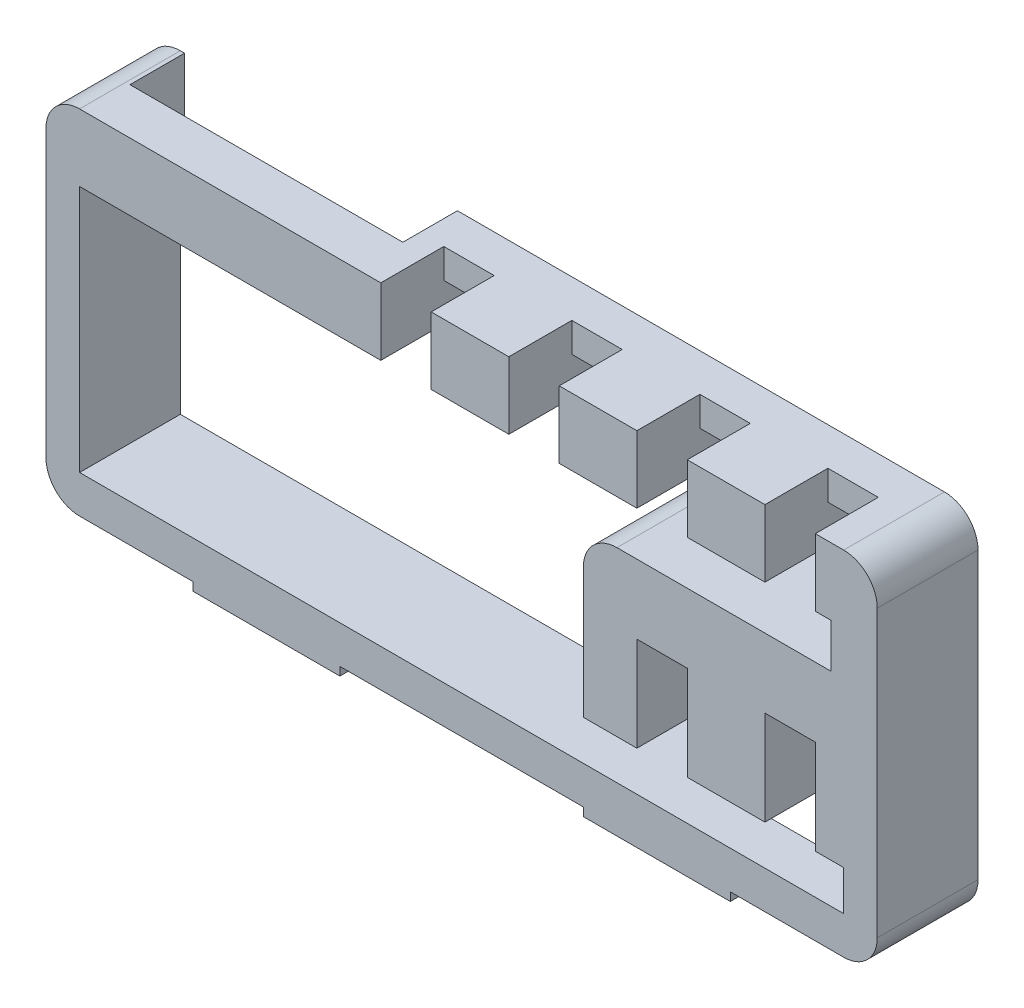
ISO-10303-21;
HEADER;
FILE_DESCRIPTION(('STEP AP214'),'2;1');
FILE_NAME('part.step','',(''),(''),'','','');
FILE_SCHEMA(('AUTOMOTIVE_DESIGN { 1 0 10303 214 1 1 1 1 }'));
ENDSEC;
DATA;
#1=APPLICATION_CONTEXT('core data for automotive mechanical design processes');
#2=APPLICATION_PROTOCOL_DEFINITION('international standard','automotive_design',2000,#1);
#3=PRODUCT_CONTEXT('',#1,'mechanical');
#4=PRODUCT('Part','Part','',(#3));
#5=PRODUCT_RELATED_PRODUCT_CATEGORY('part','',(#4));
#6=PRODUCT_DEFINITION_FORMATION('','',#4);
#7=PRODUCT_DEFINITION_CONTEXT('part definition',#1,'design');
#8=PRODUCT_DEFINITION('design','',#6,#7);
#9=PRODUCT_DEFINITION_SHAPE('','',#8);
#10=(LENGTH_UNIT() NAMED_UNIT(*) SI_UNIT(.MILLI.,.METRE.));
#11=(NAMED_UNIT(*) PLANE_ANGLE_UNIT() SI_UNIT($,.RADIAN.));
#12=(NAMED_UNIT(*) SI_UNIT($,.STERADIAN.) SOLID_ANGLE_UNIT());
#13=UNCERTAINTY_MEASURE_WITH_UNIT(LENGTH_MEASURE(1.E-05),#10,'distance_accuracy_value','');
#14=(GEOMETRIC_REPRESENTATION_CONTEXT(3) GLOBAL_UNCERTAINTY_ASSIGNED_CONTEXT((#13)) GLOBAL_UNIT_ASSIGNED_CONTEXT((#10,
#11,#12)) REPRESENTATION_CONTEXT('',''));
#15=CARTESIAN_POINT('',(0.,0.,0.));
#16=DIRECTION('',(0.,0.,1.));
#17=DIRECTION('',(1.,0.,0.));
#18=AXIS2_PLACEMENT_3D('',#15,#16,#17);
#19=CARTESIAN_POINT('',(0.,0.,0.));
#20=DIRECTION('',(0.,0.,1.));
#21=DIRECTION('',(1.,0.,0.));
#22=AXIS2_PLACEMENT_3D('',#19,#20,#21);
#23=PLANE('',#22);
#24=DIRECTION('',(0.,-1.,0.));
#25=VECTOR('',#24,1.);
#26=CARTESIAN_POINT('',(-9.96318271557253,-4.18213582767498,0.));
#27=LINE('',#26,#25);
#28=CARTESIAN_POINT('',(-9.96318271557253,-12.5940321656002,0.));
#29=VERTEX_POINT('',#28);
#30=CARTESIAN_POINT('',(-9.96318271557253,-14.7940321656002,0.));
#31=VERTEX_POINT('',#30);
#32=EDGE_CURVE('E628',#29,#31,#27,.T.);
#33=ORIENTED_EDGE('',*,*,#32,.T.);
#34=DIRECTION('',(1.,0.,0.));
#35=VECTOR('',#34,1.);
#36=CARTESIAN_POINT('',(-7.16318271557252,-14.7940321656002,0.));
#37=LINE('',#36,#35);
#38=CARTESIAN_POINT('',(-14.1631827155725,-14.7940321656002,0.));
#39=VERTEX_POINT('',#38);
#40=EDGE_CURVE('E456',#39,#31,#37,.T.);
#41=ORIENTED_EDGE('',*,*,#40,.F.);
#42=DIRECTION('',(0.,-1.,0.));
#43=VECTOR('',#42,1.);
#44=CARTESIAN_POINT('',(-14.1631827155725,-14.3940321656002,0.));
#45=LINE('',#44,#43);
#46=CARTESIAN_POINT('',(-14.1631827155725,-14.3940321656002,0.));
#47=VERTEX_POINT('',#46);
#48=EDGE_CURVE('E500',#47,#39,#45,.T.);
#49=ORIENTED_EDGE('',*,*,#48,.F.);
#50=DIRECTION('',(1.,0.,0.));
#51=VECTOR('',#50,1.);
#52=CARTESIAN_POINT('',(-39.7631827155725,-14.3940321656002,0.));
#53=LINE('',#52,#51);
#54=CARTESIAN_POINT('',(-25.7631827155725,-14.3940321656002,0.));
#55=VERTEX_POINT('',#54);
#56=EDGE_CURVE('E840',#55,#47,#53,.T.);
#57=ORIENTED_EDGE('',*,*,#56,.F.);
#58=DIRECTION('',(0.,1.,0.));
#59=VECTOR('',#58,1.);
#60=CARTESIAN_POINT('',(-25.7631827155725,-14.3940321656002,0.));
#61=LINE('',#60,#59);
#62=CARTESIAN_POINT('',(-25.7631827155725,-14.7940321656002,0.));
#63=VERTEX_POINT('',#62);
#64=EDGE_CURVE('E478',#63,#55,#61,.T.);
#65=ORIENTED_EDGE('',*,*,#64,.F.);
#66=DIRECTION('',(1.,0.,0.));
#67=VECTOR('',#66,1.);
#68=CARTESIAN_POINT('',(-25.7631827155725,-14.7940321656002,0.));
#69=LINE('',#68,#67);
#70=CARTESIAN_POINT('',(-32.7631827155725,-14.7940321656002,0.));
#71=VERTEX_POINT('',#70);
#72=EDGE_CURVE('E469',#71,#63,#69,.T.);
#73=ORIENTED_EDGE('',*,*,#72,.F.);
#74=DIRECTION('',(0.,-1.,0.));
#75=VECTOR('',#74,1.);
#76=CARTESIAN_POINT('',(-32.7631827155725,-14.3940321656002,0.));
#77=LINE('',#76,#75);
#78=CARTESIAN_POINT('',(-32.7631827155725,-14.3940321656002,0.));
#79=VERTEX_POINT('',#78);
#80=EDGE_CURVE('E474',#79,#71,#77,.T.);
#81=ORIENTED_EDGE('',*,*,#80,.F.);
#82=CARTESIAN_POINT('',(-38.1631827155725,-14.3940321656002,0.));
#83=VERTEX_POINT('',#82);
#84=EDGE_CURVE('E837',#83,#79,#53,.T.);
#85=ORIENTED_EDGE('',*,*,#84,.F.);
#86=CARTESIAN_POINT('',(-38.1631827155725,-12.7940321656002,0.));
#87=DIRECTION('',(0.,0.,1.));
#88=DIRECTION('',(1.,0.,0.));
#89=AXIS2_PLACEMENT_3D('',#86,#87,#88);
#90=CIRCLE('',#89,1.6);
#91=CARTESIAN_POINT('',(-39.7631827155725,-12.7940321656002,0.));
#92=VERTEX_POINT('',#91);
#93=EDGE_CURVE('E853',#83,#92,#90,.F.);
#94=ORIENTED_EDGE('',*,*,#93,.T.);
#95=DIRECTION('',(0.,-1.,0.));
#96=VECTOR('',#95,1.);
#97=CARTESIAN_POINT('',(-39.7631827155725,2.40596783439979,0.));
#98=LINE('',#97,#96);
#99=CARTESIAN_POINT('',(-39.7631827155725,0.805967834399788,0.));
#100=VERTEX_POINT('',#99);
#101=EDGE_CURVE('E814',#100,#92,#98,.T.);
#102=ORIENTED_EDGE('',*,*,#101,.F.);
#103=CARTESIAN_POINT('',(-38.1631827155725,0.805967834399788,0.));
#104=DIRECTION('',(0.,0.,1.));
#105=DIRECTION('',(1.,0.,0.));
#106=AXIS2_PLACEMENT_3D('',#103,#104,#105);
#107=CIRCLE('',#106,1.6);
#108=CARTESIAN_POINT('',(-38.1631827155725,2.40596783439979,0.));
#109=VERTEX_POINT('',#108);
#110=EDGE_CURVE('E850',#100,#109,#107,.F.);
#111=ORIENTED_EDGE('',*,*,#110,.T.);
#112=DIRECTION('',(-1.,0.,0.));
#113=VECTOR('',#112,1.);
#114=CARTESIAN_POINT('',(-39.7631827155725,2.40596783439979,0.));
#115=LINE('',#114,#113);
#116=CARTESIAN_POINT('',(-37.9631827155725,2.40596783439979,0.));
#117=VERTEX_POINT('',#116);
#118=EDGE_CURVE('E843',#117,#109,#115,.T.);
#119=ORIENTED_EDGE('',*,*,#118,.F.);
#120=DIRECTION('',(0.,1.,0.));
#121=VECTOR('',#120,1.);
#122=CARTESIAN_POINT('',(-37.9631827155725,-14.0514829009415,0.));
#123=LINE('',#122,#121);
#124=CARTESIAN_POINT('',(-37.9631827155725,-0.794032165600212,0.));
#125=VERTEX_POINT('',#124);
#126=EDGE_CURVE('E598',#125,#117,#123,.T.);
#127=ORIENTED_EDGE('',*,*,#126,.F.);
#128=DIRECTION('',(-1.,0.,0.));
#129=VECTOR('',#128,1.);
#130=CARTESIAN_POINT('',(-38.1631827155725,-0.794032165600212,0.));
#131=LINE('',#130,#129);
#132=CARTESIAN_POINT('',(-38.1631827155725,-0.794032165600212,0.));
#133=VERTEX_POINT('',#132);
#134=EDGE_CURVE('E802',#125,#133,#131,.T.);
#135=ORIENTED_EDGE('',*,*,#134,.T.);
#136=DIRECTION('',(0.,-1.,0.));
#137=VECTOR('',#136,1.);
#138=CARTESIAN_POINT('',(-38.1631827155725,-0.794032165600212,0.));
#139=LINE('',#138,#137);
#140=CARTESIAN_POINT('',(-38.1631827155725,-12.5940321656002,0.));
#141=VERTEX_POINT('',#140);
#142=EDGE_CURVE('E770',#133,#141,#139,.T.);
#143=ORIENTED_EDGE('',*,*,#142,.T.);
#144=DIRECTION('',(1.,0.,0.));
#145=VECTOR('',#144,1.);
#146=CARTESIAN_POINT('',(-38.1631827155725,-12.5940321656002,0.));
#147=LINE('',#146,#145);
#148=EDGE_CURVE('E796',#141,#29,#147,.T.);
#149=ORIENTED_EDGE('',*,*,#148,.T.);
#150=EDGE_LOOP('',(#33,#41,#49,#57,#65,#73,#81,#85,#94,#102,#111,#119,#127,#135,#143,#149));
#151=FACE_BOUND('',#150,.T.);
#152=ADVANCED_FACE('F32',(#151),#23,.F.);
#153=CARTESIAN_POINT('',(-7.16318271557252,-14.7940321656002,11.8114192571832));
#154=DIRECTION('',(0.,1.,0.));
#155=DIRECTION('',(-1.,0.,0.));
#156=AXIS2_PLACEMENT_3D('',#153,#154,#155);
#157=PLANE('',#156);
#158=DIRECTION('',(0.,0.,-1.));
#159=VECTOR('',#158,1.);
#160=CARTESIAN_POINT('',(-9.96318271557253,-14.7940321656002,5.4284271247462));
#161=LINE('',#160,#159);
#162=CARTESIAN_POINT('',(-9.96318271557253,-14.7940321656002,2.6));
#163=VERTEX_POINT('',#162);
#164=EDGE_CURVE('E442',#163,#31,#161,.T.);
#165=ORIENTED_EDGE('',*,*,#164,.F.);
#166=DIRECTION('',(1.,0.,0.));
#167=VECTOR('',#166,1.);
#168=CARTESIAN_POINT('',(-7.16318271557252,-14.7940321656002,2.6));
#169=LINE('',#168,#167);
#170=CARTESIAN_POINT('',(-7.16318271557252,-14.7940321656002,2.6));
#171=VERTEX_POINT('',#170);
#172=EDGE_CURVE('E449',#163,#171,#169,.T.);
#173=ORIENTED_EDGE('',*,*,#172,.T.);
#174=DIRECTION('',(0.,0.,-1.));
#175=VECTOR('',#174,1.);
#176=CARTESIAN_POINT('',(-7.16318271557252,-14.7940321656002,11.8114192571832));
#177=LINE('',#176,#175);
#178=CARTESIAN_POINT('',(-7.16318271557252,-14.7940321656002,4.8));
#179=VERTEX_POINT('',#178);
#180=EDGE_CURVE('E485',#179,#171,#177,.T.);
#181=ORIENTED_EDGE('',*,*,#180,.F.);
#182=DIRECTION('',(1.,0.,0.));
#183=VECTOR('',#182,1.);
#184=CARTESIAN_POINT('',(-7.16318271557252,-14.7940321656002,4.8));
#185=LINE('',#184,#183);
#186=CARTESIAN_POINT('',(-14.1631827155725,-14.7940321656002,4.8));
#187=VERTEX_POINT('',#186);
#188=EDGE_CURVE('E498',#187,#179,#185,.T.);
#189=ORIENTED_EDGE('',*,*,#188,.F.);
#190=DIRECTION('',(0.,0.,-1.));
#191=VECTOR('',#190,1.);
#192=CARTESIAN_POINT('',(-14.1631827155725,-14.7940321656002,11.8114192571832));
#193=LINE('',#192,#191);
#194=EDGE_CURVE('E499',#187,#39,#193,.T.);
#195=ORIENTED_EDGE('',*,*,#194,.T.);
#196=ORIENTED_EDGE('',*,*,#40,.T.);
#197=EDGE_LOOP('',(#165,#173,#181,#189,#195,#196));
#198=FACE_BOUND('',#197,.T.);
#199=ADVANCED_FACE('F454',(#198),#157,.F.);
#200=CARTESIAN_POINT('',(-38.1631827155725,-0.794032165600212,4.8));
#201=DIRECTION('',(0.,-1.,0.));
#202=DIRECTION('',(0.,0.,-1.));
#203=AXIS2_PLACEMENT_3D('',#200,#201,#202);
#204=PLANE('',#203);
#205=CARTESIAN_POINT('',(-2.36318271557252,-0.794032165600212,0.));
#206=VERTEX_POINT('',#205);
#207=CARTESIAN_POINT('',(-3.11318271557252,-0.794032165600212,0.));
#208=VERTEX_POINT('',#207);
#209=EDGE_CURVE('E782',#206,#208,#131,.T.);
#210=ORIENTED_EDGE('',*,*,#209,.F.);
#211=DIRECTION('',(0.,0.,-1.));
#212=VECTOR('',#211,1.);
#213=CARTESIAN_POINT('',(-2.36318271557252,-0.794032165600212,6.98403296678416));
#214=LINE('',#213,#212);
#215=CARTESIAN_POINT('',(-2.36318271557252,-0.794032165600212,4.8));
#216=VERTEX_POINT('',#215);
#217=EDGE_CURVE('E463',#216,#206,#214,.T.);
#218=ORIENTED_EDGE('',*,*,#217,.F.);
#219=DIRECTION('',(-1.,0.,0.));
#220=VECTOR('',#219,1.);
#221=CARTESIAN_POINT('',(-38.1631827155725,-0.794032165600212,4.8));
#222=LINE('',#221,#220);
#223=CARTESIAN_POINT('',(-3.11318271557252,-0.794032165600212,4.8));
#224=VERTEX_POINT('',#223);
#225=EDGE_CURVE('E788',#216,#224,#222,.T.);
#226=ORIENTED_EDGE('',*,*,#225,.T.);
#227=DIRECTION('',(0.,0.,-1.));
#228=VECTOR('',#227,1.);
#229=CARTESIAN_POINT('',(-3.11318271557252,-0.794032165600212,7.8));
#230=LINE('',#229,#228);
#231=EDGE_CURVE('E646',#224,#208,#230,.T.);
#232=ORIENTED_EDGE('',*,*,#231,.T.);
#233=EDGE_LOOP('',(#210,#218,#226,#232));
#234=FACE_BOUND('',#233,.T.);
#235=ADVANCED_FACE('F1101',(#234),#204,.T.);
#236=CARTESIAN_POINT('',(-1.76318271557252,-2.89403216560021,18.0257324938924));
#237=DIRECTION('',(0.,-1.,0.));
#238=DIRECTION('',(1.,0.,0.));
#239=AXIS2_PLACEMENT_3D('',#236,#237,#238);
#240=PLANE('',#239);
#241=DIRECTION('',(0.,0.,-1.));
#242=VECTOR('',#241,1.);
#243=CARTESIAN_POINT('',(-2.36318271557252,-2.89403216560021,6.98403296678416));
#244=LINE('',#243,#242);
#245=CARTESIAN_POINT('',(-2.36318271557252,-2.89403216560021,4.8));
#246=VERTEX_POINT('',#245);
#247=CARTESIAN_POINT('',(-2.36318271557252,-2.89403216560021,0.));
#248=VERTEX_POINT('',#247);
#249=EDGE_CURVE('E462',#246,#248,#244,.T.);
#250=ORIENTED_EDGE('',*,*,#249,.T.);
#251=DIRECTION('',(-1.,0.,0.));
#252=VECTOR('',#251,1.);
#253=CARTESIAN_POINT('',(-1.76318271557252,-2.89403216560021,0.));
#254=LINE('',#253,#252);
#255=CARTESIAN_POINT('',(-12.5631827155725,-2.89403216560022,0.));
#256=VERTEX_POINT('',#255);
#257=EDGE_CURVE('E748',#248,#256,#254,.T.);
#258=ORIENTED_EDGE('',*,*,#257,.T.);
#259=DIRECTION('',(0.,0.,-1.));
#260=VECTOR('',#259,1.);
#261=CARTESIAN_POINT('',(-12.5631827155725,-2.89403216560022,18.0257324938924));
#262=LINE('',#261,#260);
#263=CARTESIAN_POINT('',(-12.5631827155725,-2.89403216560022,4.8));
#264=VERTEX_POINT('',#263);
#265=EDGE_CURVE('E40',#256,#264,#262,.F.);
#266=ORIENTED_EDGE('',*,*,#265,.T.);
#267=DIRECTION('',(-1.,0.,0.));
#268=VECTOR('',#267,1.);
#269=CARTESIAN_POINT('',(-1.76318271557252,-2.89403216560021,4.8));
#270=LINE('',#269,#268);
#271=EDGE_CURVE('E756',#246,#264,#270,.T.);
#272=ORIENTED_EDGE('',*,*,#271,.F.);
#273=EDGE_LOOP('',(#250,#258,#266,#272));
#274=FACE_BOUND('',#273,.T.);
#275=ADVANCED_FACE('F907',(#274),#240,.F.);
#276=CARTESIAN_POINT('',(-39.7631827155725,-14.3940321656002,4.8));
#277=DIRECTION('',(0.,1.,0.));
#278=DIRECTION('',(0.,0.,1.));
#279=AXIS2_PLACEMENT_3D('',#276,#277,#278);
#280=PLANE('',#279);
#281=DIRECTION('',(0.,0.,-1.));
#282=VECTOR('',#281,1.);
#283=CARTESIAN_POINT('',(-25.7631827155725,-14.3940321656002,11.8114192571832));
#284=LINE('',#283,#282);
#285=CARTESIAN_POINT('',(-25.7631827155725,-14.3940321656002,4.8));
#286=VERTEX_POINT('',#285);
#287=EDGE_CURVE('E481',#286,#55,#284,.T.);
#288=ORIENTED_EDGE('',*,*,#287,.T.);
#289=ORIENTED_EDGE('',*,*,#56,.T.);
#290=DIRECTION('',(0.,0.,-1.));
#291=VECTOR('',#290,1.);
#292=CARTESIAN_POINT('',(-14.1631827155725,-14.3940321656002,11.8114192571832));
#293=LINE('',#292,#291);
#294=CARTESIAN_POINT('',(-14.1631827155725,-14.3940321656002,4.8));
#295=VERTEX_POINT('',#294);
#296=EDGE_CURVE('E503',#295,#47,#293,.T.);
#297=ORIENTED_EDGE('',*,*,#296,.F.);
#298=DIRECTION('',(1.,0.,0.));
#299=VECTOR('',#298,1.);
#300=CARTESIAN_POINT('',(-39.7631827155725,-14.3940321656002,4.8));
#301=LINE('',#300,#299);
#302=EDGE_CURVE('E824',#286,#295,#301,.T.);
#303=ORIENTED_EDGE('',*,*,#302,.F.);
#304=EDGE_LOOP('',(#288,#289,#297,#303));
#305=FACE_BOUND('',#304,.T.);
#306=ADVANCED_FACE('F1070',(#305),#280,.F.);
#307=DIRECTION('',(0.,0.,-1.));
#308=VECTOR('',#307,1.);
#309=CARTESIAN_POINT('',(-32.7631827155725,-14.3940321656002,11.8114192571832));
#310=LINE('',#309,#308);
#311=CARTESIAN_POINT('',(-32.7631827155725,-14.3940321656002,4.8));
#312=VERTEX_POINT('',#311);
#313=EDGE_CURVE('E477',#312,#79,#310,.T.);
#314=ORIENTED_EDGE('',*,*,#313,.F.);
#315=CARTESIAN_POINT('',(-38.1631827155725,-14.3940321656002,4.8));
#316=VERTEX_POINT('',#315);
#317=EDGE_CURVE('E820',#316,#312,#301,.T.);
#318=ORIENTED_EDGE('',*,*,#317,.F.);
#319=DIRECTION('',(0.,0.,-1.));
#320=VECTOR('',#319,1.);
#321=CARTESIAN_POINT('',(-38.1631827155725,-14.3940321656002,4.8));
#322=LINE('',#321,#320);
#323=EDGE_CURVE('E860',#316,#83,#322,.T.);
#324=ORIENTED_EDGE('',*,*,#323,.T.);
#325=ORIENTED_EDGE('',*,*,#84,.T.);
#326=EDGE_LOOP('',(#314,#318,#324,#325));
#327=FACE_BOUND('',#326,.T.);
#328=ADVANCED_FACE('F1055',(#327),#280,.F.);
#329=DIRECTION('',(0.,0.,-1.));
#330=VECTOR('',#329,1.);
#331=CARTESIAN_POINT('',(-7.16318271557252,-14.3940321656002,11.8114192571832));
#332=LINE('',#331,#330);
#333=CARTESIAN_POINT('',(-7.16318271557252,-14.3940321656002,4.8));
#334=VERTEX_POINT('',#333);
#335=CARTESIAN_POINT('',(-7.16318271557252,-14.3940321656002,2.6));
#336=VERTEX_POINT('',#335);
#337=EDGE_CURVE('E513',#334,#336,#332,.T.);
#338=ORIENTED_EDGE('',*,*,#337,.T.);
#339=DIRECTION('',(-1.,0.,0.));
#340=VECTOR('',#339,1.);
#341=CARTESIAN_POINT('',(-9.96318271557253,-14.3940321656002,2.6));
#342=LINE('',#341,#340);
#343=CARTESIAN_POINT('',(-1.96318271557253,-14.3940321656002,2.6));
#344=VERTEX_POINT('',#343);
#345=EDGE_CURVE('E622',#344,#336,#342,.T.);
#346=ORIENTED_EDGE('',*,*,#345,.F.);
#347=DIRECTION('',(0.,0.,1.));
#348=VECTOR('',#347,1.);
#349=CARTESIAN_POINT('',(-1.96318271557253,-14.3940321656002,0.));
#350=LINE('',#349,#348);
#351=CARTESIAN_POINT('',(-1.96318271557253,-14.3940321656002,0.));
#352=VERTEX_POINT('',#351);
#353=EDGE_CURVE('E621',#352,#344,#350,.T.);
#354=ORIENTED_EDGE('',*,*,#353,.F.);
#355=CARTESIAN_POINT('',(-1.76318271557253,-14.3940321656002,0.));
#356=VERTEX_POINT('',#355);
#357=EDGE_CURVE('E836',#352,#356,#53,.T.);
#358=ORIENTED_EDGE('',*,*,#357,.T.);
#359=DIRECTION('',(0.,0.,-1.));
#360=VECTOR('',#359,1.);
#361=CARTESIAN_POINT('',(-1.76318271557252,-14.3940321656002,4.8));
#362=LINE('',#361,#360);
#363=CARTESIAN_POINT('',(-1.76318271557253,-14.3940321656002,4.8));
#364=VERTEX_POINT('',#363);
#365=EDGE_CURVE('E863',#356,#364,#362,.F.);
#366=ORIENTED_EDGE('',*,*,#365,.T.);
#367=EDGE_CURVE('E818',#334,#364,#301,.T.);
#368=ORIENTED_EDGE('',*,*,#367,.F.);
#369=EDGE_LOOP('',(#338,#346,#354,#358,#366,#368));
#370=FACE_BOUND('',#369,.T.);
#371=ADVANCED_FACE('F1078',(#370),#280,.F.);
#372=CARTESIAN_POINT('',(0.,0.,4.8));
#373=DIRECTION('',(0.,0.,1.));
#374=DIRECTION('',(1.,0.,0.));
#375=AXIS2_PLACEMENT_3D('',#372,#373,#374);
#376=PLANE('',#375);
#377=ORIENTED_EDGE('',*,*,#225,.F.);
#378=DIRECTION('',(0.,-1.,0.));
#379=VECTOR('',#378,1.);
#380=CARTESIAN_POINT('',(-2.36318271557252,-2.89403216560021,4.8));
#381=LINE('',#380,#379);
#382=EDGE_CURVE('E55',#216,#246,#381,.T.);
#383=ORIENTED_EDGE('',*,*,#382,.T.);
#384=ORIENTED_EDGE('',*,*,#271,.T.);
#385=CARTESIAN_POINT('',(-12.5631827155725,-4.49403216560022,4.8));
#386=DIRECTION('',(0.,0.,1.));
#387=DIRECTION('',(1.,0.,0.));
#388=AXIS2_PLACEMENT_3D('',#385,#386,#387);
#389=CIRCLE('',#388,1.6);
#390=CARTESIAN_POINT('',(-14.1631827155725,-4.49403216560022,4.8));
#391=VERTEX_POINT('',#390);
#392=EDGE_CURVE('E11',#264,#391,#389,.T.);
#393=ORIENTED_EDGE('',*,*,#392,.T.);
#394=DIRECTION('',(0.,-1.,0.));
#395=VECTOR('',#394,1.);
#396=CARTESIAN_POINT('',(-14.1631827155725,-10.6940321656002,4.8));
#397=LINE('',#396,#395);
#398=CARTESIAN_POINT('',(-14.1631827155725,-10.6940321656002,4.8));
#399=VERTEX_POINT('',#398);
#400=EDGE_CURVE('E768',#391,#399,#397,.T.);
#401=ORIENTED_EDGE('',*,*,#400,.T.);
#402=DIRECTION('',(1.,0.,0.));
#403=VECTOR('',#402,1.);
#404=CARTESIAN_POINT('',(-1.76318271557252,-10.6940321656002,4.8));
#405=LINE('',#404,#403);
#406=CARTESIAN_POINT('',(-11.6131827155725,-10.6940321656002,4.8));
#407=VERTEX_POINT('',#406);
#408=EDGE_CURVE('E771',#399,#407,#405,.T.);
#409=ORIENTED_EDGE('',*,*,#408,.T.);
#410=DIRECTION('',(0.,-1.,0.));
#411=VECTOR('',#410,1.);
#412=CARTESIAN_POINT('',(-11.6131827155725,-10.6940321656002,4.8));
#413=LINE('',#412,#411);
#414=CARTESIAN_POINT('',(-11.6131827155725,-6.19403216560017,4.8));
#415=VERTEX_POINT('',#414);
#416=EDGE_CURVE('E664',#415,#407,#413,.T.);
#417=ORIENTED_EDGE('',*,*,#416,.F.);
#418=DIRECTION('',(1.,0.,0.));
#419=VECTOR('',#418,1.);
#420=CARTESIAN_POINT('',(0.,-6.19403216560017,4.8));
#421=LINE('',#420,#419);
#422=CARTESIAN_POINT('',(-9.21318271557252,-6.19403216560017,4.8));
#423=VERTEX_POINT('',#422);
#424=EDGE_CURVE('E540',#415,#423,#421,.T.);
#425=ORIENTED_EDGE('',*,*,#424,.T.);
#426=DIRECTION('',(0.,1.,0.));
#427=VECTOR('',#426,1.);
#428=CARTESIAN_POINT('',(-9.21318271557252,-10.6940321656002,4.8));
#429=LINE('',#428,#427);
#430=CARTESIAN_POINT('',(-9.21318271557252,-10.6940321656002,4.8));
#431=VERTEX_POINT('',#430);
#432=EDGE_CURVE('E661',#431,#423,#429,.T.);
#433=ORIENTED_EDGE('',*,*,#432,.F.);
#434=CARTESIAN_POINT('',(-5.51318271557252,-10.6940321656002,4.8));
#435=VERTEX_POINT('',#434);
#436=EDGE_CURVE('E774',#431,#435,#405,.T.);
#437=ORIENTED_EDGE('',*,*,#436,.T.);
#438=DIRECTION('',(0.,-1.,0.));
#439=VECTOR('',#438,1.);
#440=CARTESIAN_POINT('',(-5.51318271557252,-10.6940321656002,4.8));
#441=LINE('',#440,#439);
#442=CARTESIAN_POINT('',(-5.51318271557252,-6.19403216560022,4.8));
#443=VERTEX_POINT('',#442);
#444=EDGE_CURVE('E678',#443,#435,#441,.T.);
#445=ORIENTED_EDGE('',*,*,#444,.F.);
#446=DIRECTION('',(1.,0.,0.));
#447=VECTOR('',#446,1.);
#448=CARTESIAN_POINT('',(0.,-6.19403216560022,4.8));
#449=LINE('',#448,#447);
#450=CARTESIAN_POINT('',(-3.11318271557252,-6.19403216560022,4.8));
#451=VERTEX_POINT('',#450);
#452=EDGE_CURVE('E528',#443,#451,#449,.T.);
#453=ORIENTED_EDGE('',*,*,#452,.T.);
#454=DIRECTION('',(0.,1.,0.));
#455=VECTOR('',#454,1.);
#456=CARTESIAN_POINT('',(-3.11318271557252,-10.6940321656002,4.8));
#457=LINE('',#456,#455);
#458=CARTESIAN_POINT('',(-3.11318271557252,-10.6940321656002,4.8));
#459=VERTEX_POINT('',#458);
#460=EDGE_CURVE('E670',#459,#451,#457,.T.);
#461=ORIENTED_EDGE('',*,*,#460,.F.);
#462=CARTESIAN_POINT('',(-1.76318271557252,-10.6940321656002,4.8));
#463=VERTEX_POINT('',#462);
#464=EDGE_CURVE('E762',#459,#463,#405,.T.);
#465=ORIENTED_EDGE('',*,*,#464,.T.);
#466=DIRECTION('',(0.,1.,0.));
#467=VECTOR('',#466,1.);
#468=CARTESIAN_POINT('',(-1.76318271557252,-0.794032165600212,4.8));
#469=LINE('',#468,#467);
#470=CARTESIAN_POINT('',(-1.76318271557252,-12.5940321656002,4.8));
#471=VERTEX_POINT('',#470);
#472=EDGE_CURVE('E784',#471,#463,#469,.T.);
#473=ORIENTED_EDGE('',*,*,#472,.F.);
#474=DIRECTION('',(1.,0.,0.));
#475=VECTOR('',#474,1.);
#476=CARTESIAN_POINT('',(-38.1631827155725,-12.5940321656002,4.8));
#477=LINE('',#476,#475);
#478=CARTESIAN_POINT('',(-38.1631827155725,-12.5940321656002,4.8));
#479=VERTEX_POINT('',#478);
#480=EDGE_CURVE('E781',#479,#471,#477,.T.);
#481=ORIENTED_EDGE('',*,*,#480,.F.);
#482=DIRECTION('',(0.,-1.,0.));
#483=VECTOR('',#482,1.);
#484=CARTESIAN_POINT('',(-38.1631827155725,-0.794032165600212,4.8));
#485=LINE('',#484,#483);
#486=CARTESIAN_POINT('',(-38.1631827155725,-0.794032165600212,4.8));
#487=VERTEX_POINT('',#486);
#488=EDGE_CURVE('E779',#487,#479,#485,.T.);
#489=ORIENTED_EDGE('',*,*,#488,.F.);
#490=CARTESIAN_POINT('',(-23.8131827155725,-0.794032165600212,4.8));
#491=VERTEX_POINT('',#490);
#492=EDGE_CURVE('E787',#491,#487,#222,.T.);
#493=ORIENTED_EDGE('',*,*,#492,.F.);
#494=DIRECTION('',(0.,-1.,0.));
#495=VECTOR('',#494,1.);
#496=CARTESIAN_POINT('',(-23.8131827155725,-0.794032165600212,4.8));
#497=LINE('',#496,#495);
#498=CARTESIAN_POINT('',(-23.8131827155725,2.40596783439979,4.8));
#499=VERTEX_POINT('',#498);
#500=EDGE_CURVE('E735',#499,#491,#497,.T.);
#501=ORIENTED_EDGE('',*,*,#500,.F.);
#502=DIRECTION('',(-1.,0.,0.));
#503=VECTOR('',#502,1.);
#504=CARTESIAN_POINT('',(-39.7631827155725,2.40596783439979,4.8));
#505=LINE('',#504,#503);
#506=CARTESIAN_POINT('',(-38.1631827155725,2.40596783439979,4.8));
#507=VERTEX_POINT('',#506);
#508=EDGE_CURVE('E827',#499,#507,#505,.T.);
#509=ORIENTED_EDGE('',*,*,#508,.T.);
#510=CARTESIAN_POINT('',(-38.1631827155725,0.805967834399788,4.8));
#511=DIRECTION('',(0.,0.,1.));
#512=DIRECTION('',(1.,0.,0.));
#513=AXIS2_PLACEMENT_3D('',#510,#511,#512);
#514=CIRCLE('',#513,1.6);
#515=CARTESIAN_POINT('',(-39.7631827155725,0.805967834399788,4.8));
#516=VERTEX_POINT('',#515);
#517=EDGE_CURVE('E866',#507,#516,#514,.T.);
#518=ORIENTED_EDGE('',*,*,#517,.T.);
#519=DIRECTION('',(0.,-1.,0.));
#520=VECTOR('',#519,1.);
#521=CARTESIAN_POINT('',(-39.7631827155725,2.40596783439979,4.8));
#522=LINE('',#521,#520);
#523=CARTESIAN_POINT('',(-39.7631827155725,-12.7940321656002,4.8));
#524=VERTEX_POINT('',#523);
#525=EDGE_CURVE('E815',#516,#524,#522,.T.);
#526=ORIENTED_EDGE('',*,*,#525,.T.);
#527=CARTESIAN_POINT('',(-38.1631827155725,-12.7940321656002,4.8));
#528=DIRECTION('',(0.,0.,1.));
#529=DIRECTION('',(1.,0.,0.));
#530=AXIS2_PLACEMENT_3D('',#527,#528,#529);
#531=CIRCLE('',#530,1.6);
#532=EDGE_CURVE('E868',#524,#316,#531,.T.);
#533=ORIENTED_EDGE('',*,*,#532,.T.);
#534=ORIENTED_EDGE('',*,*,#317,.T.);
#535=DIRECTION('',(0.,-1.,0.));
#536=VECTOR('',#535,1.);
#537=CARTESIAN_POINT('',(-32.7631827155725,-14.3940321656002,4.8));
#538=LINE('',#537,#536);
#539=CARTESIAN_POINT('',(-32.7631827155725,-14.7940321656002,4.8));
#540=VERTEX_POINT('',#539);
#541=EDGE_CURVE('E482',#312,#540,#538,.T.);
#542=ORIENTED_EDGE('',*,*,#541,.T.);
#543=DIRECTION('',(1.,0.,0.));
#544=VECTOR('',#543,1.);
#545=CARTESIAN_POINT('',(-25.7631827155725,-14.7940321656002,4.8));
#546=LINE('',#545,#544);
#547=CARTESIAN_POINT('',(-25.7631827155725,-14.7940321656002,4.8));
#548=VERTEX_POINT('',#547);
#549=EDGE_CURVE('E472',#540,#548,#546,.T.);
#550=ORIENTED_EDGE('',*,*,#549,.T.);
#551=DIRECTION('',(0.,1.,0.));
#552=VECTOR('',#551,1.);
#553=CARTESIAN_POINT('',(-25.7631827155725,-14.3940321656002,4.8));
#554=LINE('',#553,#552);
#555=EDGE_CURVE('E486',#548,#286,#554,.T.);
#556=ORIENTED_EDGE('',*,*,#555,.T.);
#557=ORIENTED_EDGE('',*,*,#302,.T.);
#558=DIRECTION('',(0.,-1.,0.));
#559=VECTOR('',#558,1.);
#560=CARTESIAN_POINT('',(-14.1631827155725,-14.3940321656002,4.8));
#561=LINE('',#560,#559);
#562=EDGE_CURVE('E504',#295,#187,#561,.T.);
#563=ORIENTED_EDGE('',*,*,#562,.T.);
#564=ORIENTED_EDGE('',*,*,#188,.T.);
#565=DIRECTION('',(0.,1.,0.));
#566=VECTOR('',#565,1.);
#567=CARTESIAN_POINT('',(-7.16318271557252,-14.3940321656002,4.8));
#568=LINE('',#567,#566);
#569=EDGE_CURVE('E508',#179,#334,#568,.T.);
#570=ORIENTED_EDGE('',*,*,#569,.T.);
#571=ORIENTED_EDGE('',*,*,#367,.T.);
#572=CARTESIAN_POINT('',(-1.76318271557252,-12.7940321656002,4.8));
#573=DIRECTION('',(0.,0.,1.));
#574=DIRECTION('',(1.,0.,0.));
#575=AXIS2_PLACEMENT_3D('',#572,#573,#574);
#576=CIRCLE('',#575,1.6);
#577=CARTESIAN_POINT('',(-0.163182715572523,-12.7940321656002,4.8));
#578=VERTEX_POINT('',#577);
#579=EDGE_CURVE('E872',#364,#578,#576,.T.);
#580=ORIENTED_EDGE('',*,*,#579,.T.);
#581=DIRECTION('',(0.,1.,0.));
#582=VECTOR('',#581,1.);
#583=CARTESIAN_POINT('',(-0.163182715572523,2.40596783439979,4.8));
#584=LINE('',#583,#582);
#585=CARTESIAN_POINT('',(-0.163182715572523,0.805967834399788,4.8));
#586=VERTEX_POINT('',#585);
#587=EDGE_CURVE('E823',#578,#586,#584,.T.);
#588=ORIENTED_EDGE('',*,*,#587,.T.);
#589=CARTESIAN_POINT('',(-1.76318271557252,0.805967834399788,4.8));
#590=DIRECTION('',(0.,0.,1.));
#591=DIRECTION('',(1.,0.,0.));
#592=AXIS2_PLACEMENT_3D('',#589,#590,#591);
#593=CIRCLE('',#592,1.6);
#594=CARTESIAN_POINT('',(-1.76318271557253,2.40596783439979,4.8));
#595=VERTEX_POINT('',#594);
#596=EDGE_CURVE('E870',#586,#595,#593,.T.);
#597=ORIENTED_EDGE('',*,*,#596,.T.);
#598=CARTESIAN_POINT('',(-3.11318271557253,2.40596783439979,4.8));
#599=VERTEX_POINT('',#598);
#600=EDGE_CURVE('E828',#595,#599,#505,.T.);
#601=ORIENTED_EDGE('',*,*,#600,.T.);
#602=DIRECTION('',(0.,1.,0.));
#603=VECTOR('',#602,1.);
#604=CARTESIAN_POINT('',(-3.11318271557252,-0.794032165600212,4.8));
#605=LINE('',#604,#603);
#606=EDGE_CURVE('E652',#224,#599,#605,.T.);
#607=ORIENTED_EDGE('',*,*,#606,.F.);
#608=EDGE_LOOP('',(#377,#383,#384,#393,#401,#409,#417,#425,#433,#437,#445,#453,#461,#465,#473,
#481,#489,#493,#501,#509,#518,#526,#533,#534,#542,#550,#556,#557,#563,#564,#570,#571,#580,#588,
#597,#601,#607));
#609=FACE_BOUND('',#608,.T.);
#610=ADVANCED_FACE('F912',(#609),#376,.T.);
#611=DIRECTION('',(0.,-1.,0.));
#612=VECTOR('',#611,1.);
#613=CARTESIAN_POINT('',(-2.36318271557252,-2.89403216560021,0.));
#614=LINE('',#613,#612);
#615=EDGE_CURVE('E460',#206,#248,#614,.T.);
#616=ORIENTED_EDGE('',*,*,#615,.F.);
#617=ORIENTED_EDGE('',*,*,#209,.T.);
#618=DIRECTION('',(0.,1.,0.));
#619=VECTOR('',#618,1.);
#620=CARTESIAN_POINT('',(-3.11318271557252,-0.794032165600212,0.));
#621=LINE('',#620,#619);
#622=CARTESIAN_POINT('',(-3.11318271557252,1.00596783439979,0.));
#623=VERTEX_POINT('',#622);
#624=EDGE_CURVE('E643',#208,#623,#621,.T.);
#625=ORIENTED_EDGE('',*,*,#624,.T.);
#626=DIRECTION('',(-1.,0.,0.));
#627=VECTOR('',#626,1.);
#628=CARTESIAN_POINT('',(-5.51318271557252,1.00596783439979,0.));
#629=LINE('',#628,#627);
#630=CARTESIAN_POINT('',(-5.51318271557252,1.00596783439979,0.));
#631=VERTEX_POINT('',#630);
#632=EDGE_CURVE('E638',#623,#631,#629,.T.);
#633=ORIENTED_EDGE('',*,*,#632,.T.);
#634=DIRECTION('',(0.,-1.,0.));
#635=VECTOR('',#634,1.);
#636=CARTESIAN_POINT('',(-5.51318271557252,-0.794032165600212,0.));
#637=LINE('',#636,#635);
#638=CARTESIAN_POINT('',(-5.51318271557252,-0.794032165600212,0.));
#639=VERTEX_POINT('',#638);
#640=EDGE_CURVE('E647',#631,#639,#637,.T.);
#641=ORIENTED_EDGE('',*,*,#640,.T.);
#642=CARTESIAN_POINT('',(-9.21318271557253,-0.794032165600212,0.));
#643=VERTEX_POINT('',#642);
#644=EDGE_CURVE('E804',#639,#643,#131,.T.);
#645=ORIENTED_EDGE('',*,*,#644,.T.);
#646=DIRECTION('',(0.,1.,0.));
#647=VECTOR('',#646,1.);
#648=CARTESIAN_POINT('',(-9.21318271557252,-0.794032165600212,0.));
#649=LINE('',#648,#647);
#650=CARTESIAN_POINT('',(-9.21318271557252,1.00596783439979,0.));
#651=VERTEX_POINT('',#650);
#652=EDGE_CURVE('E717',#643,#651,#649,.T.);
#653=ORIENTED_EDGE('',*,*,#652,.T.);
#654=DIRECTION('',(-1.,0.,0.));
#655=VECTOR('',#654,1.);
#656=CARTESIAN_POINT('',(-11.6131827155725,1.00596783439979,0.));
#657=LINE('',#656,#655);
#658=CARTESIAN_POINT('',(-11.6131827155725,1.00596783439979,0.));
#659=VERTEX_POINT('',#658);
#660=EDGE_CURVE('E712',#651,#659,#657,.T.);
#661=ORIENTED_EDGE('',*,*,#660,.T.);
#662=DIRECTION('',(0.,-1.,0.));
#663=VECTOR('',#662,1.);
#664=CARTESIAN_POINT('',(-11.6131827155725,-0.794032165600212,0.));
#665=LINE('',#664,#663);
#666=CARTESIAN_POINT('',(-11.6131827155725,-0.794032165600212,0.));
#667=VERTEX_POINT('',#666);
#668=EDGE_CURVE('E721',#659,#667,#665,.T.);
#669=ORIENTED_EDGE('',*,*,#668,.T.);
#670=CARTESIAN_POINT('',(-15.3131827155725,-0.794032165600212,0.));
#671=VERTEX_POINT('',#670);
#672=EDGE_CURVE('E1008',#667,#671,#131,.T.);
#673=ORIENTED_EDGE('',*,*,#672,.T.);
#674=DIRECTION('',(0.,1.,0.));
#675=VECTOR('',#674,1.);
#676=CARTESIAN_POINT('',(-15.3131827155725,-0.794032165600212,0.));
#677=LINE('',#676,#675);
#678=CARTESIAN_POINT('',(-15.3131827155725,1.00596783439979,0.));
#679=VERTEX_POINT('',#678);
#680=EDGE_CURVE('E693',#671,#679,#677,.T.);
#681=ORIENTED_EDGE('',*,*,#680,.T.);
#682=DIRECTION('',(-1.,0.,0.));
#683=VECTOR('',#682,1.);
#684=CARTESIAN_POINT('',(-17.7131827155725,1.00596783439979,0.));
#685=LINE('',#684,#683);
#686=CARTESIAN_POINT('',(-17.7131827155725,1.00596783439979,0.));
#687=VERTEX_POINT('',#686);
#688=EDGE_CURVE('E688',#679,#687,#685,.T.);
#689=ORIENTED_EDGE('',*,*,#688,.T.);
#690=DIRECTION('',(0.,-1.,0.));
#691=VECTOR('',#690,1.);
#692=CARTESIAN_POINT('',(-17.7131827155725,-0.794032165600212,0.));
#693=LINE('',#692,#691);
#694=CARTESIAN_POINT('',(-17.7131827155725,-0.794032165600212,0.));
#695=VERTEX_POINT('',#694);
#696=EDGE_CURVE('E697',#687,#695,#693,.T.);
#697=ORIENTED_EDGE('',*,*,#696,.T.);
#698=CARTESIAN_POINT('',(-21.4131827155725,-0.794032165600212,0.));
#699=VERTEX_POINT('',#698);
#700=EDGE_CURVE('E1010',#695,#699,#131,.T.);
#701=ORIENTED_EDGE('',*,*,#700,.T.);
#702=DIRECTION('',(0.,1.,0.));
#703=VECTOR('',#702,1.);
#704=CARTESIAN_POINT('',(-21.4131827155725,-0.794032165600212,0.));
#705=LINE('',#704,#703);
#706=CARTESIAN_POINT('',(-21.4131827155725,1.00596783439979,0.));
#707=VERTEX_POINT('',#706);
#708=EDGE_CURVE('E737',#699,#707,#705,.T.);
#709=ORIENTED_EDGE('',*,*,#708,.T.);
#710=DIRECTION('',(-1.,0.,0.));
#711=VECTOR('',#710,1.);
#712=CARTESIAN_POINT('',(-23.8131827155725,1.00596783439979,0.));
#713=LINE('',#712,#711);
#714=CARTESIAN_POINT('',(-23.8131827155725,1.00596783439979,0.));
#715=VERTEX_POINT('',#714);
#716=EDGE_CURVE('E732',#707,#715,#713,.T.);
#717=ORIENTED_EDGE('',*,*,#716,.T.);
#718=DIRECTION('',(0.,-1.,0.));
#719=VECTOR('',#718,1.);
#720=CARTESIAN_POINT('',(-23.8131827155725,-0.794032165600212,0.));
#721=LINE('',#720,#719);
#722=CARTESIAN_POINT('',(-23.8131827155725,-0.794032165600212,0.));
#723=VERTEX_POINT('',#722);
#724=EDGE_CURVE('E741',#715,#723,#721,.T.);
#725=ORIENTED_EDGE('',*,*,#724,.T.);
#726=CARTESIAN_POINT('',(-24.9631827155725,-0.794032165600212,0.));
#727=VERTEX_POINT('',#726);
#728=EDGE_CURVE('E805',#723,#727,#131,.T.);
#729=ORIENTED_EDGE('',*,*,#728,.T.);
#730=DIRECTION('',(0.,1.,0.));
#731=VECTOR('',#730,1.);
#732=CARTESIAN_POINT('',(-24.9631827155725,-14.0514829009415,0.));
#733=LINE('',#732,#731);
#734=CARTESIAN_POINT('',(-24.9631827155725,2.40596783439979,0.));
#735=VERTEX_POINT('',#734);
#736=EDGE_CURVE('E606',#727,#735,#733,.T.);
#737=ORIENTED_EDGE('',*,*,#736,.T.);
#738=CARTESIAN_POINT('',(-1.76318271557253,2.40596783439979,0.));
#739=VERTEX_POINT('',#738);
#740=EDGE_CURVE('E819',#739,#735,#115,.T.);
#741=ORIENTED_EDGE('',*,*,#740,.F.);
#742=CARTESIAN_POINT('',(-1.76318271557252,0.805967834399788,0.));
#743=DIRECTION('',(0.,0.,1.));
#744=DIRECTION('',(1.,0.,0.));
#745=AXIS2_PLACEMENT_3D('',#742,#743,#744);
#746=CIRCLE('',#745,1.6);
#747=CARTESIAN_POINT('',(-0.163182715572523,0.805967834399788,0.));
#748=VERTEX_POINT('',#747);
#749=EDGE_CURVE('E855',#739,#748,#746,.F.);
#750=ORIENTED_EDGE('',*,*,#749,.T.);
#751=DIRECTION('',(0.,1.,0.));
#752=VECTOR('',#751,1.);
#753=CARTESIAN_POINT('',(-0.163182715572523,2.40596783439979,0.));
#754=LINE('',#753,#752);
#755=CARTESIAN_POINT('',(-0.163182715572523,-12.7940321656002,0.));
#756=VERTEX_POINT('',#755);
#757=EDGE_CURVE('E839',#756,#748,#754,.T.);
#758=ORIENTED_EDGE('',*,*,#757,.F.);
#759=CARTESIAN_POINT('',(-1.76318271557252,-12.7940321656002,0.));
#760=DIRECTION('',(0.,0.,1.));
#761=DIRECTION('',(1.,0.,0.));
#762=AXIS2_PLACEMENT_3D('',#759,#760,#761);
#763=CIRCLE('',#762,1.6);
#764=EDGE_CURVE('E857',#756,#356,#763,.F.);
#765=ORIENTED_EDGE('',*,*,#764,.T.);
#766=ORIENTED_EDGE('',*,*,#357,.F.);
#767=DIRECTION('',(0.,-1.,0.));
#768=VECTOR('',#767,1.);
#769=CARTESIAN_POINT('',(-1.96318271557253,-4.18213582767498,0.));
#770=LINE('',#769,#768);
#771=CARTESIAN_POINT('',(-1.96318271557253,-12.5940321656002,0.));
#772=VERTEX_POINT('',#771);
#773=EDGE_CURVE('E624',#772,#352,#770,.T.);
#774=ORIENTED_EDGE('',*,*,#773,.F.);
#775=CARTESIAN_POINT('',(-1.76318271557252,-12.5940321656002,0.));
#776=VERTEX_POINT('',#775);
#777=EDGE_CURVE('E795',#772,#776,#147,.T.);
#778=ORIENTED_EDGE('',*,*,#777,.T.);
#779=DIRECTION('',(0.,1.,0.));
#780=VECTOR('',#779,1.);
#781=CARTESIAN_POINT('',(-1.76318271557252,-0.794032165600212,0.));
#782=LINE('',#781,#780);
#783=CARTESIAN_POINT('',(-1.76318271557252,-10.6940321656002,0.));
#784=VERTEX_POINT('',#783);
#785=EDGE_CURVE('E799',#776,#784,#782,.T.);
#786=ORIENTED_EDGE('',*,*,#785,.T.);
#787=DIRECTION('',(1.,0.,0.));
#788=VECTOR('',#787,1.);
#789=CARTESIAN_POINT('',(-1.76318271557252,-10.6940321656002,0.));
#790=LINE('',#789,#788);
#791=CARTESIAN_POINT('',(-3.11318271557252,-10.6940321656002,0.));
#792=VERTEX_POINT('',#791);
#793=EDGE_CURVE('E764',#792,#784,#790,.T.);
#794=ORIENTED_EDGE('',*,*,#793,.F.);
#795=DIRECTION('',(0.,1.,0.));
#796=VECTOR('',#795,1.);
#797=CARTESIAN_POINT('',(-3.11318271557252,-10.6940321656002,0.));
#798=LINE('',#797,#796);
#799=CARTESIAN_POINT('',(-3.11318271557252,-6.19403216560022,0.));
#800=VERTEX_POINT('',#799);
#801=EDGE_CURVE('E676',#792,#800,#798,.T.);
#802=ORIENTED_EDGE('',*,*,#801,.T.);
#803=DIRECTION('',(-1.,0.,0.));
#804=VECTOR('',#803,1.);
#805=CARTESIAN_POINT('',(-5.51318271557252,-6.19403216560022,0.));
#806=LINE('',#805,#804);
#807=CARTESIAN_POINT('',(-5.51318271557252,-6.19403216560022,0.));
#808=VERTEX_POINT('',#807);
#809=EDGE_CURVE('E507',#800,#808,#806,.T.);
#810=ORIENTED_EDGE('',*,*,#809,.T.);
#811=DIRECTION('',(0.,-1.,0.));
#812=VECTOR('',#811,1.);
#813=CARTESIAN_POINT('',(-5.51318271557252,-10.6940321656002,0.));
#814=LINE('',#813,#812);
#815=CARTESIAN_POINT('',(-5.51318271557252,-10.6940321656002,0.));
#816=VERTEX_POINT('',#815);
#817=EDGE_CURVE('E637',#808,#816,#814,.T.);
#818=ORIENTED_EDGE('',*,*,#817,.T.);
#819=CARTESIAN_POINT('',(-9.21318271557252,-10.6940321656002,0.));
#820=VERTEX_POINT('',#819);
#821=EDGE_CURVE('E763',#820,#816,#790,.T.);
#822=ORIENTED_EDGE('',*,*,#821,.F.);
#823=DIRECTION('',(0.,1.,0.));
#824=VECTOR('',#823,1.);
#825=CARTESIAN_POINT('',(-9.21318271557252,-10.6940321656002,0.));
#826=LINE('',#825,#824);
#827=CARTESIAN_POINT('',(-9.21318271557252,-6.19403216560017,0.));
#828=VERTEX_POINT('',#827);
#829=EDGE_CURVE('E662',#820,#828,#826,.T.);
#830=ORIENTED_EDGE('',*,*,#829,.T.);
#831=DIRECTION('',(-1.,0.,0.));
#832=VECTOR('',#831,1.);
#833=CARTESIAN_POINT('',(-11.6131827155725,-6.19403216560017,0.));
#834=LINE('',#833,#832);
#835=CARTESIAN_POINT('',(-11.6131827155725,-6.19403216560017,0.));
#836=VERTEX_POINT('',#835);
#837=EDGE_CURVE('E531',#828,#836,#834,.T.);
#838=ORIENTED_EDGE('',*,*,#837,.T.);
#839=DIRECTION('',(0.,-1.,0.));
#840=VECTOR('',#839,1.);
#841=CARTESIAN_POINT('',(-11.6131827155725,-10.6940321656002,0.));
#842=LINE('',#841,#840);
#843=CARTESIAN_POINT('',(-11.6131827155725,-10.6940321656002,0.));
#844=VERTEX_POINT('',#843);
#845=EDGE_CURVE('E666',#836,#844,#842,.T.);
#846=ORIENTED_EDGE('',*,*,#845,.T.);
#847=CARTESIAN_POINT('',(-14.1631827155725,-10.6940321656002,0.));
#848=VERTEX_POINT('',#847);
#849=EDGE_CURVE('E759',#848,#844,#790,.T.);
#850=ORIENTED_EDGE('',*,*,#849,.F.);
#851=DIRECTION('',(0.,-1.,0.));
#852=VECTOR('',#851,1.);
#853=CARTESIAN_POINT('',(-14.1631827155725,-10.6940321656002,0.));
#854=LINE('',#853,#852);
#855=CARTESIAN_POINT('',(-14.1631827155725,-4.49403216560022,0.));
#856=VERTEX_POINT('',#855);
#857=EDGE_CURVE('E765',#856,#848,#854,.T.);
#858=ORIENTED_EDGE('',*,*,#857,.F.);
#859=CARTESIAN_POINT('',(-12.5631827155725,-4.49403216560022,0.));
#860=DIRECTION('',(0.,0.,1.));
#861=DIRECTION('',(1.,0.,0.));
#862=AXIS2_PLACEMENT_3D('',#859,#860,#861);
#863=CIRCLE('',#862,1.6);
#864=EDGE_CURVE('E900',#856,#256,#863,.F.);
#865=ORIENTED_EDGE('',*,*,#864,.T.);
#866=ORIENTED_EDGE('',*,*,#257,.F.);
#867=EDGE_LOOP('',(#616,#617,#625,#633,#641,#645,#653,#661,#669,#673,#681,#689,#697,#701,#709,
#717,#725,#729,#737,#741,#750,#758,#765,#766,#774,#778,#786,#794,#802,#810,#818,#822,#830,#838,
#846,#850,#858,#865,#866));
#868=FACE_BOUND('',#867,.T.);
#869=ADVANCED_FACE('F933',(#868),#23,.F.);
#870=DIRECTION('',(0.,-1.,0.));
#871=VECTOR('',#870,1.);
#872=CARTESIAN_POINT('',(-17.7131827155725,-0.794032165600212,4.8));
#873=LINE('',#872,#871);
#874=CARTESIAN_POINT('',(-17.7131827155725,2.40596783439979,4.8));
#875=VERTEX_POINT('',#874);
#876=CARTESIAN_POINT('',(-17.7131827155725,-0.794032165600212,4.8));
#877=VERTEX_POINT('',#876);
#878=EDGE_CURVE('E691',#875,#877,#873,.T.);
#879=ORIENTED_EDGE('',*,*,#878,.F.);
#880=CARTESIAN_POINT('',(-21.4131827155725,2.40596783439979,4.8));
#881=VERTEX_POINT('',#880);
#882=EDGE_CURVE('E833',#875,#881,#505,.T.);
#883=ORIENTED_EDGE('',*,*,#882,.T.);
#884=DIRECTION('',(0.,1.,0.));
#885=VECTOR('',#884,1.);
#886=CARTESIAN_POINT('',(-21.4131827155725,-0.794032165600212,4.8));
#887=LINE('',#886,#885);
#888=CARTESIAN_POINT('',(-21.4131827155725,-0.794032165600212,4.8));
#889=VERTEX_POINT('',#888);
#890=EDGE_CURVE('E745',#889,#881,#887,.T.);
#891=ORIENTED_EDGE('',*,*,#890,.F.);
#892=EDGE_CURVE('E792',#877,#889,#222,.T.);
#893=ORIENTED_EDGE('',*,*,#892,.F.);
#894=EDGE_LOOP('',(#879,#883,#891,#893));
#895=FACE_BOUND('',#894,.T.);
#896=ADVANCED_FACE('F1154',(#895),#376,.T.);
#897=CARTESIAN_POINT('',(-11.6131827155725,2.40596783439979,4.8));
#898=VERTEX_POINT('',#897);
#899=CARTESIAN_POINT('',(-15.3131827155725,2.40596783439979,4.8));
#900=VERTEX_POINT('',#899);
#901=EDGE_CURVE('E989',#898,#900,#505,.T.);
#902=ORIENTED_EDGE('',*,*,#901,.T.);
#903=DIRECTION('',(0.,1.,0.));
#904=VECTOR('',#903,1.);
#905=CARTESIAN_POINT('',(-15.3131827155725,-0.794032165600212,4.8));
#906=LINE('',#905,#904);
#907=CARTESIAN_POINT('',(-15.3131827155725,-0.794032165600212,4.8));
#908=VERTEX_POINT('',#907);
#909=EDGE_CURVE('E702',#908,#900,#906,.T.);
#910=ORIENTED_EDGE('',*,*,#909,.F.);
#911=CARTESIAN_POINT('',(-11.6131827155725,-0.794032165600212,4.8));
#912=VERTEX_POINT('',#911);
#913=EDGE_CURVE('E972',#912,#908,#222,.T.);
#914=ORIENTED_EDGE('',*,*,#913,.F.);
#915=DIRECTION('',(0.,-1.,0.));
#916=VECTOR('',#915,1.);
#917=CARTESIAN_POINT('',(-11.6131827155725,-0.794032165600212,4.8));
#918=LINE('',#917,#916);
#919=EDGE_CURVE('E715',#898,#912,#918,.T.);
#920=ORIENTED_EDGE('',*,*,#919,.F.);
#921=EDGE_LOOP('',(#902,#910,#914,#920));
#922=FACE_BOUND('',#921,.T.);
#923=ADVANCED_FACE('F987',(#922),#376,.T.);
#924=CARTESIAN_POINT('',(-5.51318271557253,2.40596783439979,4.8));
#925=VERTEX_POINT('',#924);
#926=CARTESIAN_POINT('',(-9.21318271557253,2.40596783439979,4.8));
#927=VERTEX_POINT('',#926);
#928=EDGE_CURVE('E832',#925,#927,#505,.T.);
#929=ORIENTED_EDGE('',*,*,#928,.T.);
#930=DIRECTION('',(0.,1.,0.));
#931=VECTOR('',#930,1.);
#932=CARTESIAN_POINT('',(-9.21318271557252,-0.794032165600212,4.8));
#933=LINE('',#932,#931);
#934=CARTESIAN_POINT('',(-9.21318271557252,-0.794032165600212,4.8));
#935=VERTEX_POINT('',#934);
#936=EDGE_CURVE('E711',#935,#927,#933,.T.);
#937=ORIENTED_EDGE('',*,*,#936,.F.);
#938=CARTESIAN_POINT('',(-5.51318271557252,-0.794032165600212,4.8));
#939=VERTEX_POINT('',#938);
#940=EDGE_CURVE('E791',#939,#935,#222,.T.);
#941=ORIENTED_EDGE('',*,*,#940,.F.);
#942=DIRECTION('',(0.,-1.,0.));
#943=VECTOR('',#942,1.);
#944=CARTESIAN_POINT('',(-5.51318271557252,-0.794032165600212,4.8));
#945=LINE('',#944,#943);
#946=EDGE_CURVE('E641',#925,#939,#945,.T.);
#947=ORIENTED_EDGE('',*,*,#946,.F.);
#948=EDGE_LOOP('',(#929,#937,#941,#947));
#949=FACE_BOUND('',#948,.T.);
#950=ADVANCED_FACE('F1119',(#949),#376,.T.);
#951=ORIENTED_EDGE('',*,*,#644,.F.);
#952=DIRECTION('',(0.,0.,-1.));
#953=VECTOR('',#952,1.);
#954=CARTESIAN_POINT('',(-5.51318271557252,-0.794032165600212,7.8));
#955=LINE('',#954,#953);
#956=EDGE_CURVE('E650',#939,#639,#955,.T.);
#957=ORIENTED_EDGE('',*,*,#956,.F.);
#958=ORIENTED_EDGE('',*,*,#940,.T.);
#959=DIRECTION('',(0.,0.,-1.));
#960=VECTOR('',#959,1.);
#961=CARTESIAN_POINT('',(-9.21318271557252,-0.794032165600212,7.8));
#962=LINE('',#961,#960);
#963=EDGE_CURVE('E720',#935,#643,#962,.T.);
#964=ORIENTED_EDGE('',*,*,#963,.T.);
#965=EDGE_LOOP('',(#951,#957,#958,#964));
#966=FACE_BOUND('',#965,.T.);
#967=ADVANCED_FACE('F1115',(#966),#204,.T.);
#968=ORIENTED_EDGE('',*,*,#672,.F.);
#969=DIRECTION('',(0.,0.,-1.));
#970=VECTOR('',#969,1.);
#971=CARTESIAN_POINT('',(-11.6131827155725,-0.794032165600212,7.8));
#972=LINE('',#971,#970);
#973=EDGE_CURVE('E724',#912,#667,#972,.T.);
#974=ORIENTED_EDGE('',*,*,#973,.F.);
#975=ORIENTED_EDGE('',*,*,#913,.T.);
#976=DIRECTION('',(0.,0.,-1.));
#977=VECTOR('',#976,1.);
#978=CARTESIAN_POINT('',(-15.3131827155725,-0.794032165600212,7.8));
#979=LINE('',#978,#977);
#980=EDGE_CURVE('E696',#908,#671,#979,.T.);
#981=ORIENTED_EDGE('',*,*,#980,.T.);
#982=EDGE_LOOP('',(#968,#974,#975,#981));
#983=FACE_BOUND('',#982,.T.);
#984=ADVANCED_FACE('F982',(#983),#204,.T.);
#985=ORIENTED_EDGE('',*,*,#700,.F.);
#986=DIRECTION('',(0.,0.,-1.));
#987=VECTOR('',#986,1.);
#988=CARTESIAN_POINT('',(-17.7131827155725,-0.794032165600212,7.8));
#989=LINE('',#988,#987);
#990=EDGE_CURVE('E700',#877,#695,#989,.T.);
#991=ORIENTED_EDGE('',*,*,#990,.F.);
#992=ORIENTED_EDGE('',*,*,#892,.T.);
#993=DIRECTION('',(0.,0.,-1.));
#994=VECTOR('',#993,1.);
#995=CARTESIAN_POINT('',(-21.4131827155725,-0.794032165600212,7.8));
#996=LINE('',#995,#994);
#997=EDGE_CURVE('E740',#889,#699,#996,.T.);
#998=ORIENTED_EDGE('',*,*,#997,.T.);
#999=EDGE_LOOP('',(#985,#991,#992,#998));
#1000=FACE_BOUND('',#999,.T.);
#1001=ADVANCED_FACE('F1217',(#1000),#204,.T.);
#1002=CARTESIAN_POINT('',(-1.76318271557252,-10.6940321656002,17.6062484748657));
#1003=DIRECTION('',(0.,1.,0.));
#1004=DIRECTION('',(-1.,0.,0.));
#1005=AXIS2_PLACEMENT_3D('',#1002,#1003,#1004);
#1006=PLANE('',#1005);
#1007=DIRECTION('',(0.,0.,-1.));
#1008=VECTOR('',#1007,1.);
#1009=CARTESIAN_POINT('',(-5.51318271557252,-10.6940321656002,7.8));
#1010=LINE('',#1009,#1008);
#1011=EDGE_CURVE('E682',#435,#816,#1010,.T.);
#1012=ORIENTED_EDGE('',*,*,#1011,.F.);
#1013=ORIENTED_EDGE('',*,*,#436,.F.);
#1014=DIRECTION('',(0.,0.,-1.));
#1015=VECTOR('',#1014,1.);
#1016=CARTESIAN_POINT('',(-9.21318271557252,-10.6940321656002,7.8));
#1017=LINE('',#1016,#1015);
#1018=EDGE_CURVE('E665',#431,#820,#1017,.T.);
#1019=ORIENTED_EDGE('',*,*,#1018,.T.);
#1020=ORIENTED_EDGE('',*,*,#821,.T.);
#1021=EDGE_LOOP('',(#1012,#1013,#1019,#1020));
#1022=FACE_BOUND('',#1021,.T.);
#1023=ADVANCED_FACE('F942',(#1022),#1006,.F.);
#1024=DIRECTION('',(0.,0.,-1.));
#1025=VECTOR('',#1024,1.);
#1026=CARTESIAN_POINT('',(-3.11318271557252,-10.6940321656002,7.8));
#1027=LINE('',#1026,#1025);
#1028=EDGE_CURVE('E679',#459,#792,#1027,.T.);
#1029=ORIENTED_EDGE('',*,*,#1028,.T.);
#1030=ORIENTED_EDGE('',*,*,#793,.T.);
#1031=DIRECTION('',(0.,0.,-1.));
#1032=VECTOR('',#1031,1.);
#1033=CARTESIAN_POINT('',(-1.76318271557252,-10.6940321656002,17.6062484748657));
#1034=LINE('',#1033,#1032);
#1035=EDGE_CURVE('E758',#463,#784,#1034,.T.);
#1036=ORIENTED_EDGE('',*,*,#1035,.F.);
#1037=ORIENTED_EDGE('',*,*,#464,.F.);
#1038=EDGE_LOOP('',(#1029,#1030,#1036,#1037));
#1039=FACE_BOUND('',#1038,.T.);
#1040=ADVANCED_FACE('F953',(#1039),#1006,.F.);
#1041=DIRECTION('',(0.,0.,-1.));
#1042=VECTOR('',#1041,1.);
#1043=CARTESIAN_POINT('',(-11.6131827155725,-10.6940321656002,7.8));
#1044=LINE('',#1043,#1042);
#1045=EDGE_CURVE('E669',#407,#844,#1044,.T.);
#1046=ORIENTED_EDGE('',*,*,#1045,.F.);
#1047=ORIENTED_EDGE('',*,*,#408,.F.);
#1048=DIRECTION('',(0.,0.,-1.));
#1049=VECTOR('',#1048,1.);
#1050=CARTESIAN_POINT('',(-14.1631827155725,-10.6940321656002,17.6062484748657));
#1051=LINE('',#1050,#1049);
#1052=EDGE_CURVE('E767',#399,#848,#1051,.T.);
#1053=ORIENTED_EDGE('',*,*,#1052,.T.);
#1054=ORIENTED_EDGE('',*,*,#849,.T.);
#1055=EDGE_LOOP('',(#1046,#1047,#1053,#1054));
#1056=FACE_BOUND('',#1055,.T.);
#1057=ADVANCED_FACE('F921',(#1056),#1006,.F.);
#1058=DIRECTION('',(0.,0.,1.));
#1059=VECTOR('',#1058,1.);
#1060=CARTESIAN_POINT('',(-37.9631827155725,-0.794032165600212,0.));
#1061=LINE('',#1060,#1059);
#1062=CARTESIAN_POINT('',(-37.9631827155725,-0.794032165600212,2.6));
#1063=VERTEX_POINT('',#1062);
#1064=EDGE_CURVE('E612',#125,#1063,#1061,.T.);
#1065=ORIENTED_EDGE('',*,*,#1064,.T.);
#1066=DIRECTION('',(1.,0.,0.));
#1067=VECTOR('',#1066,1.);
#1068=CARTESIAN_POINT('',(-24.9631827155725,-0.794032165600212,2.6));
#1069=LINE('',#1068,#1067);
#1070=CARTESIAN_POINT('',(-24.9631827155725,-0.794032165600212,2.6));
#1071=VERTEX_POINT('',#1070);
#1072=EDGE_CURVE('E608',#1063,#1071,#1069,.T.);
#1073=ORIENTED_EDGE('',*,*,#1072,.T.);
#1074=DIRECTION('',(0.,0.,-1.));
#1075=VECTOR('',#1074,1.);
#1076=CARTESIAN_POINT('',(-24.9631827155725,-0.794032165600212,0.));
#1077=LINE('',#1076,#1075);
#1078=EDGE_CURVE('E603',#1071,#727,#1077,.T.);
#1079=ORIENTED_EDGE('',*,*,#1078,.T.);
#1080=ORIENTED_EDGE('',*,*,#728,.F.);
#1081=DIRECTION('',(0.,0.,-1.));
#1082=VECTOR('',#1081,1.);
#1083=CARTESIAN_POINT('',(-23.8131827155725,-0.794032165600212,7.8));
#1084=LINE('',#1083,#1082);
#1085=EDGE_CURVE('E744',#491,#723,#1084,.T.);
#1086=ORIENTED_EDGE('',*,*,#1085,.F.);
#1087=ORIENTED_EDGE('',*,*,#492,.T.);
#1088=DIRECTION('',(0.,0.,-1.));
#1089=VECTOR('',#1088,1.);
#1090=CARTESIAN_POINT('',(-38.1631827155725,-0.794032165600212,4.8));
#1091=LINE('',#1090,#1089);
#1092=EDGE_CURVE('E790',#487,#133,#1091,.T.);
#1093=ORIENTED_EDGE('',*,*,#1092,.T.);
#1094=ORIENTED_EDGE('',*,*,#134,.F.);
#1095=EDGE_LOOP('',(#1065,#1073,#1079,#1080,#1086,#1087,#1093,#1094));
#1096=FACE_BOUND('',#1095,.T.);
#1097=ADVANCED_FACE('F969',(#1096),#204,.T.);
#1098=CARTESIAN_POINT('',(-1.76318271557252,-0.794032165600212,4.8));
#1099=DIRECTION('',(-1.,0.,0.));
#1100=DIRECTION('',(0.,-1.,0.));
#1101=AXIS2_PLACEMENT_3D('',#1098,#1099,#1100);
#1102=PLANE('',#1101);
#1103=ORIENTED_EDGE('',*,*,#472,.T.);
#1104=ORIENTED_EDGE('',*,*,#1035,.T.);
#1105=ORIENTED_EDGE('',*,*,#785,.F.);
#1106=DIRECTION('',(0.,0.,-1.));
#1107=VECTOR('',#1106,1.);
#1108=CARTESIAN_POINT('',(-1.76318271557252,-12.5940321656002,4.8));
#1109=LINE('',#1108,#1107);
#1110=EDGE_CURVE('E808',#471,#776,#1109,.T.);
#1111=ORIENTED_EDGE('',*,*,#1110,.F.);
#1112=EDGE_LOOP('',(#1103,#1104,#1105,#1111));
#1113=FACE_BOUND('',#1112,.T.);
#1114=ADVANCED_FACE('F951',(#1113),#1102,.T.);
#1115=CARTESIAN_POINT('',(-39.7631827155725,2.40596783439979,4.8));
#1116=DIRECTION('',(1.,0.,0.));
#1117=DIRECTION('',(0.,0.,-1.));
#1118=AXIS2_PLACEMENT_3D('',#1115,#1116,#1117);
#1119=PLANE('',#1118);
#1120=ORIENTED_EDGE('',*,*,#101,.T.);
#1121=DIRECTION('',(0.,0.,-1.));
#1122=VECTOR('',#1121,1.);
#1123=CARTESIAN_POINT('',(-39.7631827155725,-12.7940321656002,4.8));
#1124=LINE('',#1123,#1122);
#1125=EDGE_CURVE('E883',#92,#524,#1124,.F.);
#1126=ORIENTED_EDGE('',*,*,#1125,.T.);
#1127=ORIENTED_EDGE('',*,*,#525,.F.);
#1128=DIRECTION('',(0.,0.,-1.));
#1129=VECTOR('',#1128,1.);
#1130=CARTESIAN_POINT('',(-39.7631827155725,0.805967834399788,4.8));
#1131=LINE('',#1130,#1129);
#1132=EDGE_CURVE('E880',#516,#100,#1131,.T.);
#1133=ORIENTED_EDGE('',*,*,#1132,.T.);
#1134=EDGE_LOOP('',(#1120,#1126,#1127,#1133));
#1135=FACE_BOUND('',#1134,.T.);
#1136=ADVANCED_FACE('F1045',(#1135),#1119,.F.);
#1137=CARTESIAN_POINT('',(-0.163182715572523,2.40596783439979,4.8));
#1138=DIRECTION('',(-1.,0.,0.));
#1139=DIRECTION('',(0.,0.,1.));
#1140=AXIS2_PLACEMENT_3D('',#1137,#1138,#1139);
#1141=PLANE('',#1140);
#1142=ORIENTED_EDGE('',*,*,#587,.F.);
#1143=DIRECTION('',(0.,0.,-1.));
#1144=VECTOR('',#1143,1.);
#1145=CARTESIAN_POINT('',(-0.163182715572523,-12.7940321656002,4.8));
#1146=LINE('',#1145,#1144);
#1147=EDGE_CURVE('E847',#578,#756,#1146,.T.);
#1148=ORIENTED_EDGE('',*,*,#1147,.T.);
#1149=ORIENTED_EDGE('',*,*,#757,.T.);
#1150=DIRECTION('',(0.,0.,-1.));
#1151=VECTOR('',#1150,1.);
#1152=CARTESIAN_POINT('',(-0.163182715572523,0.805967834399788,4.8));
#1153=LINE('',#1152,#1151);
#1154=EDGE_CURVE('E831',#748,#586,#1153,.F.);
#1155=ORIENTED_EDGE('',*,*,#1154,.T.);
#1156=EDGE_LOOP('',(#1142,#1148,#1149,#1155));
#1157=FACE_BOUND('',#1156,.T.);
#1158=ADVANCED_FACE('F1085',(#1157),#1141,.F.);
#1159=CARTESIAN_POINT('',(-39.7631827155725,2.40596783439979,4.8));
#1160=DIRECTION('',(0.,-1.,0.));
#1161=DIRECTION('',(0.,0.,-1.));
#1162=AXIS2_PLACEMENT_3D('',#1159,#1160,#1161);
#1163=PLANE('',#1162);
#1164=ORIENTED_EDGE('',*,*,#882,.F.);
#1165=DIRECTION('',(0.,0.,1.));
#1166=VECTOR('',#1165,1.);
#1167=CARTESIAN_POINT('',(-17.7131827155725,2.40596783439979,4.8));
#1168=LINE('',#1167,#1166);
#1169=CARTESIAN_POINT('',(-17.7131827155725,2.40596783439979,1.8));
#1170=VERTEX_POINT('',#1169);
#1171=EDGE_CURVE('E544',#1170,#875,#1168,.T.);
#1172=ORIENTED_EDGE('',*,*,#1171,.F.);
#1173=DIRECTION('',(-1.,0.,0.));
#1174=VECTOR('',#1173,1.);
#1175=CARTESIAN_POINT('',(-17.7131827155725,2.40596783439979,1.8));
#1176=LINE('',#1175,#1174);
#1177=CARTESIAN_POINT('',(-15.3131827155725,2.40596783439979,1.8));
#1178=VERTEX_POINT('',#1177);
#1179=EDGE_CURVE('E551',#1178,#1170,#1176,.T.);
#1180=ORIENTED_EDGE('',*,*,#1179,.F.);
#1181=DIRECTION('',(0.,0.,-1.));
#1182=VECTOR('',#1181,1.);
#1183=CARTESIAN_POINT('',(-15.3131827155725,2.40596783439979,4.8));
#1184=LINE('',#1183,#1182);
#1185=EDGE_CURVE('E547',#900,#1178,#1184,.T.);
#1186=ORIENTED_EDGE('',*,*,#1185,.F.);
#1187=ORIENTED_EDGE('',*,*,#901,.F.);
#1188=DIRECTION('',(0.,0.,1.));
#1189=VECTOR('',#1188,1.);
#1190=CARTESIAN_POINT('',(-11.6131827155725,2.40596783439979,4.8));
#1191=LINE('',#1190,#1189);
#1192=CARTESIAN_POINT('',(-11.6131827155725,2.40596783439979,1.8));
#1193=VERTEX_POINT('',#1192);
#1194=EDGE_CURVE('E559',#1193,#898,#1191,.T.);
#1195=ORIENTED_EDGE('',*,*,#1194,.F.);
#1196=DIRECTION('',(-1.,0.,0.));
#1197=VECTOR('',#1196,1.);
#1198=CARTESIAN_POINT('',(-11.6131827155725,2.40596783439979,1.8));
#1199=LINE('',#1198,#1197);
#1200=CARTESIAN_POINT('',(-9.21318271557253,2.40596783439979,1.8));
#1201=VERTEX_POINT('',#1200);
#1202=EDGE_CURVE('E566',#1201,#1193,#1199,.T.);
#1203=ORIENTED_EDGE('',*,*,#1202,.F.);
#1204=DIRECTION('',(0.,0.,-1.));
#1205=VECTOR('',#1204,1.);
#1206=CARTESIAN_POINT('',(-9.21318271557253,2.40596783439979,4.8));
#1207=LINE('',#1206,#1205);
#1208=EDGE_CURVE('E562',#927,#1201,#1207,.T.);
#1209=ORIENTED_EDGE('',*,*,#1208,.F.);
#1210=ORIENTED_EDGE('',*,*,#928,.F.);
#1211=DIRECTION('',(0.,0.,1.));
#1212=VECTOR('',#1211,1.);
#1213=CARTESIAN_POINT('',(-5.51318271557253,2.40596783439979,4.8));
#1214=LINE('',#1213,#1212);
#1215=CARTESIAN_POINT('',(-5.51318271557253,2.40596783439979,1.8));
#1216=VERTEX_POINT('',#1215);
#1217=EDGE_CURVE('E543',#1216,#925,#1214,.T.);
#1218=ORIENTED_EDGE('',*,*,#1217,.F.);
#1219=DIRECTION('',(-1.,0.,0.));
#1220=VECTOR('',#1219,1.);
#1221=CARTESIAN_POINT('',(-5.51318271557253,2.40596783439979,1.8));
#1222=LINE('',#1221,#1220);
#1223=CARTESIAN_POINT('',(-3.11318271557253,2.40596783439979,1.8));
#1224=VERTEX_POINT('',#1223);
#1225=EDGE_CURVE('E577',#1224,#1216,#1222,.T.);
#1226=ORIENTED_EDGE('',*,*,#1225,.F.);
#1227=DIRECTION('',(0.,0.,-1.));
#1228=VECTOR('',#1227,1.);
#1229=CARTESIAN_POINT('',(-3.11318271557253,2.40596783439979,4.8));
#1230=LINE('',#1229,#1228);
#1231=EDGE_CURVE('E574',#599,#1224,#1230,.T.);
#1232=ORIENTED_EDGE('',*,*,#1231,.F.);
#1233=ORIENTED_EDGE('',*,*,#600,.F.);
#1234=DIRECTION('',(0.,0.,-1.));
#1235=VECTOR('',#1234,1.);
#1236=CARTESIAN_POINT('',(-1.76318271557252,2.40596783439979,4.8));
#1237=LINE('',#1236,#1235);
#1238=EDGE_CURVE('E877',#595,#739,#1237,.T.);
#1239=ORIENTED_EDGE('',*,*,#1238,.T.);
#1240=ORIENTED_EDGE('',*,*,#740,.T.);
#1241=DIRECTION('',(0.,0.,-1.));
#1242=VECTOR('',#1241,1.);
#1243=CARTESIAN_POINT('',(-24.9631827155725,2.40596783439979,0.));
#1244=LINE('',#1243,#1242);
#1245=CARTESIAN_POINT('',(-24.9631827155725,2.40596783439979,2.6));
#1246=VERTEX_POINT('',#1245);
#1247=EDGE_CURVE('E594',#1246,#735,#1244,.T.);
#1248=ORIENTED_EDGE('',*,*,#1247,.F.);
#1249=DIRECTION('',(1.,0.,0.));
#1250=VECTOR('',#1249,1.);
#1251=CARTESIAN_POINT('',(-24.9631827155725,2.40596783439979,2.6));
#1252=LINE('',#1251,#1250);
#1253=CARTESIAN_POINT('',(-37.9631827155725,2.40596783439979,2.6));
#1254=VERTEX_POINT('',#1253);
#1255=EDGE_CURVE('E596',#1254,#1246,#1252,.T.);
#1256=ORIENTED_EDGE('',*,*,#1255,.F.);
#1257=DIRECTION('',(0.,0.,1.));
#1258=VECTOR('',#1257,1.);
#1259=CARTESIAN_POINT('',(-37.9631827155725,2.40596783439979,0.));
#1260=LINE('',#1259,#1258);
#1261=EDGE_CURVE('E599',#117,#1254,#1260,.T.);
#1262=ORIENTED_EDGE('',*,*,#1261,.F.);
#1263=ORIENTED_EDGE('',*,*,#118,.T.);
#1264=DIRECTION('',(0.,0.,-1.));
#1265=VECTOR('',#1264,1.);
#1266=CARTESIAN_POINT('',(-38.1631827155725,2.40596783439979,4.8));
#1267=LINE('',#1266,#1265);
#1268=EDGE_CURVE('E874',#109,#507,#1267,.F.);
#1269=ORIENTED_EDGE('',*,*,#1268,.T.);
#1270=ORIENTED_EDGE('',*,*,#508,.F.);
#1271=DIRECTION('',(0.,0.,1.));
#1272=VECTOR('',#1271,1.);
#1273=CARTESIAN_POINT('',(-23.8131827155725,2.40596783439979,4.8));
#1274=LINE('',#1273,#1272);
#1275=CARTESIAN_POINT('',(-23.8131827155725,2.40596783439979,1.8));
#1276=VERTEX_POINT('',#1275);
#1277=EDGE_CURVE('E557',#1276,#499,#1274,.T.);
#1278=ORIENTED_EDGE('',*,*,#1277,.F.);
#1279=DIRECTION('',(-1.,0.,0.));
#1280=VECTOR('',#1279,1.);
#1281=CARTESIAN_POINT('',(-23.8131827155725,2.40596783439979,1.8));
#1282=LINE('',#1281,#1280);
#1283=CARTESIAN_POINT('',(-21.4131827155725,2.40596783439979,1.8));
#1284=VERTEX_POINT('',#1283);
#1285=EDGE_CURVE('E588',#1284,#1276,#1282,.T.);
#1286=ORIENTED_EDGE('',*,*,#1285,.F.);
#1287=DIRECTION('',(0.,0.,-1.));
#1288=VECTOR('',#1287,1.);
#1289=CARTESIAN_POINT('',(-21.4131827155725,2.40596783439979,4.8));
#1290=LINE('',#1289,#1288);
#1291=EDGE_CURVE('E585',#881,#1284,#1290,.T.);
#1292=ORIENTED_EDGE('',*,*,#1291,.F.);
#1293=EDGE_LOOP('',(#1164,#1172,#1180,#1186,#1187,#1195,#1203,#1209,#1210,#1218,#1226,#1232,
#1233,#1239,#1240,#1248,#1256,#1262,#1263,#1269,#1270,#1278,#1286,#1292));
#1294=FACE_BOUND('',#1293,.T.);
#1295=ADVANCED_FACE('F996',(#1294),#1163,.F.);
#1296=CARTESIAN_POINT('',(-38.1631827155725,-0.794032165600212,4.8));
#1297=DIRECTION('',(1.,0.,0.));
#1298=DIRECTION('',(0.,0.,-1.));
#1299=AXIS2_PLACEMENT_3D('',#1296,#1297,#1298);
#1300=PLANE('',#1299);
#1301=ORIENTED_EDGE('',*,*,#142,.F.);
#1302=ORIENTED_EDGE('',*,*,#1092,.F.);
#1303=ORIENTED_EDGE('',*,*,#488,.T.);
#1304=DIRECTION('',(0.,0.,-1.));
#1305=VECTOR('',#1304,1.);
#1306=CARTESIAN_POINT('',(-38.1631827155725,-12.5940321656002,4.8));
#1307=LINE('',#1306,#1305);
#1308=EDGE_CURVE('E811',#479,#141,#1307,.T.);
#1309=ORIENTED_EDGE('',*,*,#1308,.T.);
#1310=EDGE_LOOP('',(#1301,#1302,#1303,#1309));
#1311=FACE_BOUND('',#1310,.T.);
#1312=ADVANCED_FACE('F966',(#1311),#1300,.T.);
#1313=CARTESIAN_POINT('',(-38.1631827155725,-12.5940321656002,4.8));
#1314=DIRECTION('',(0.,1.,0.));
#1315=DIRECTION('',(0.,0.,1.));
#1316=AXIS2_PLACEMENT_3D('',#1313,#1314,#1315);
#1317=PLANE('',#1316);
#1318=DIRECTION('',(0.,0.,1.));
#1319=VECTOR('',#1318,1.);
#1320=CARTESIAN_POINT('',(-1.96318271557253,-12.5940321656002,0.));
#1321=LINE('',#1320,#1319);
#1322=CARTESIAN_POINT('',(-1.96318271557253,-12.5940321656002,2.6));
#1323=VERTEX_POINT('',#1322);
#1324=EDGE_CURVE('E631',#772,#1323,#1321,.T.);
#1325=ORIENTED_EDGE('',*,*,#1324,.T.);
#1326=DIRECTION('',(-1.,0.,0.));
#1327=VECTOR('',#1326,1.);
#1328=CARTESIAN_POINT('',(-9.96318271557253,-12.5940321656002,2.6));
#1329=LINE('',#1328,#1327);
#1330=CARTESIAN_POINT('',(-9.96318271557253,-12.5940321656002,2.6));
#1331=VERTEX_POINT('',#1330);
#1332=EDGE_CURVE('E447',#1323,#1331,#1329,.T.);
#1333=ORIENTED_EDGE('',*,*,#1332,.T.);
#1334=DIRECTION('',(0.,0.,-1.));
#1335=VECTOR('',#1334,1.);
#1336=CARTESIAN_POINT('',(-9.96318271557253,-12.5940321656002,0.));
#1337=LINE('',#1336,#1335);
#1338=EDGE_CURVE('E445',#1331,#29,#1337,.T.);
#1339=ORIENTED_EDGE('',*,*,#1338,.T.);
#1340=ORIENTED_EDGE('',*,*,#148,.F.);
#1341=ORIENTED_EDGE('',*,*,#1308,.F.);
#1342=ORIENTED_EDGE('',*,*,#480,.T.);
#1343=ORIENTED_EDGE('',*,*,#1110,.T.);
#1344=ORIENTED_EDGE('',*,*,#777,.F.);
#1345=EDGE_LOOP('',(#1325,#1333,#1339,#1340,#1341,#1342,#1343,#1344));
#1346=FACE_BOUND('',#1345,.T.);
#1347=ADVANCED_FACE('F959',(#1346),#1317,.T.);
#1348=CARTESIAN_POINT('',(-14.1631827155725,-10.6940321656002,17.6062484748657));
#1349=DIRECTION('',(1.,0.,0.));
#1350=DIRECTION('',(0.,0.,-1.));
#1351=AXIS2_PLACEMENT_3D('',#1348,#1349,#1350);
#1352=PLANE('',#1351);
#1353=ORIENTED_EDGE('',*,*,#400,.F.);
#1354=DIRECTION('',(0.,0.,-1.));
#1355=VECTOR('',#1354,1.);
#1356=CARTESIAN_POINT('',(-14.1631827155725,-4.49403216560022,17.6062484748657));
#1357=LINE('',#1356,#1355);
#1358=EDGE_CURVE('E897',#391,#856,#1357,.T.);
#1359=ORIENTED_EDGE('',*,*,#1358,.T.);
#1360=ORIENTED_EDGE('',*,*,#857,.T.);
#1361=ORIENTED_EDGE('',*,*,#1052,.F.);
#1362=EDGE_LOOP('',(#1353,#1359,#1360,#1361));
#1363=FACE_BOUND('',#1362,.T.);
#1364=ADVANCED_FACE('F915',(#1363),#1352,.F.);
#1365=CARTESIAN_POINT('',(-23.8131827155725,-0.794032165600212,7.8));
#1366=DIRECTION('',(1.,0.,0.));
#1367=DIRECTION('',(0.,0.,-1.));
#1368=AXIS2_PLACEMENT_3D('',#1365,#1366,#1367);
#1369=PLANE('',#1368);
#1370=DIRECTION('',(0.,0.,-1.));
#1371=VECTOR('',#1370,1.);
#1372=CARTESIAN_POINT('',(-23.8131827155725,1.00596783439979,7.8));
#1373=LINE('',#1372,#1371);
#1374=CARTESIAN_POINT('',(-23.8131827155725,1.00596783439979,1.8));
#1375=VERTEX_POINT('',#1374);
#1376=EDGE_CURVE('E704',#1375,#715,#1373,.T.);
#1377=ORIENTED_EDGE('',*,*,#1376,.F.);
#1378=DIRECTION('',(0.,1.,0.));
#1379=VECTOR('',#1378,1.);
#1380=CARTESIAN_POINT('',(-23.8131827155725,-0.594032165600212,1.8));
#1381=LINE('',#1380,#1379);
#1382=EDGE_CURVE('E592',#1375,#1276,#1381,.T.);
#1383=ORIENTED_EDGE('',*,*,#1382,.T.);
#1384=ORIENTED_EDGE('',*,*,#1277,.T.);
#1385=ORIENTED_EDGE('',*,*,#500,.T.);
#1386=ORIENTED_EDGE('',*,*,#1085,.T.);
#1387=ORIENTED_EDGE('',*,*,#724,.F.);
#1388=EDGE_LOOP('',(#1377,#1383,#1384,#1385,#1386,#1387));
#1389=FACE_BOUND('',#1388,.T.);
#1390=ADVANCED_FACE('F1034',(#1389),#1369,.T.);
#1391=CARTESIAN_POINT('',(-21.4131827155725,-0.794032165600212,7.8));
#1392=DIRECTION('',(-1.,0.,0.));
#1393=DIRECTION('',(0.,0.,1.));
#1394=AXIS2_PLACEMENT_3D('',#1391,#1392,#1393);
#1395=PLANE('',#1394);
#1396=DIRECTION('',(0.,1.,0.));
#1397=VECTOR('',#1396,1.);
#1398=CARTESIAN_POINT('',(-21.4131827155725,-0.594032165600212,1.8));
#1399=LINE('',#1398,#1397);
#1400=CARTESIAN_POINT('',(-21.4131827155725,1.00596783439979,1.8));
#1401=VERTEX_POINT('',#1400);
#1402=EDGE_CURVE('E591',#1401,#1284,#1399,.T.);
#1403=ORIENTED_EDGE('',*,*,#1402,.F.);
#1404=DIRECTION('',(0.,0.,-1.));
#1405=VECTOR('',#1404,1.);
#1406=CARTESIAN_POINT('',(-21.4131827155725,1.00596783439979,7.8));
#1407=LINE('',#1406,#1405);
#1408=EDGE_CURVE('E736',#1401,#707,#1407,.T.);
#1409=ORIENTED_EDGE('',*,*,#1408,.T.);
#1410=ORIENTED_EDGE('',*,*,#708,.F.);
#1411=ORIENTED_EDGE('',*,*,#997,.F.);
#1412=ORIENTED_EDGE('',*,*,#890,.T.);
#1413=ORIENTED_EDGE('',*,*,#1291,.T.);
#1414=EDGE_LOOP('',(#1403,#1409,#1410,#1411,#1412,#1413));
#1415=FACE_BOUND('',#1414,.T.);
#1416=ADVANCED_FACE('F1364',(#1415),#1395,.T.);
#1417=CARTESIAN_POINT('',(-23.8131827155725,1.00596783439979,7.8));
#1418=DIRECTION('',(0.,-1.,0.));
#1419=DIRECTION('',(0.,0.,-1.));
#1420=AXIS2_PLACEMENT_3D('',#1417,#1418,#1419);
#1421=PLANE('',#1420);
#1422=DIRECTION('',(1.,0.,0.));
#1423=VECTOR('',#1422,1.);
#1424=CARTESIAN_POINT('',(-23.8131827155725,1.00596783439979,1.8));
#1425=LINE('',#1424,#1423);
#1426=EDGE_CURVE('E885',#1375,#1401,#1425,.T.);
#1427=ORIENTED_EDGE('',*,*,#1426,.F.);
#1428=ORIENTED_EDGE('',*,*,#1376,.T.);
#1429=ORIENTED_EDGE('',*,*,#716,.F.);
#1430=ORIENTED_EDGE('',*,*,#1408,.F.);
#1431=EDGE_LOOP('',(#1427,#1428,#1429,#1430));
#1432=FACE_BOUND('',#1431,.T.);
#1433=ADVANCED_FACE('F1373',(#1432),#1421,.T.);
#1434=CARTESIAN_POINT('',(-11.6131827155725,-10.6940321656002,7.8));
#1435=DIRECTION('',(1.,0.,0.));
#1436=DIRECTION('',(0.,0.,-1.));
#1437=AXIS2_PLACEMENT_3D('',#1434,#1435,#1436);
#1438=PLANE('',#1437);
#1439=ORIENTED_EDGE('',*,*,#416,.T.);
#1440=ORIENTED_EDGE('',*,*,#1045,.T.);
#1441=ORIENTED_EDGE('',*,*,#845,.F.);
#1442=DIRECTION('',(0.,0.,-1.));
#1443=VECTOR('',#1442,1.);
#1444=CARTESIAN_POINT('',(-11.6131827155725,-6.19403216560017,5.));
#1445=LINE('',#1444,#1443);
#1446=EDGE_CURVE('E534',#415,#836,#1445,.T.);
#1447=ORIENTED_EDGE('',*,*,#1446,.F.);
#1448=EDGE_LOOP('',(#1439,#1440,#1441,#1447));
#1449=FACE_BOUND('',#1448,.T.);
#1450=ADVANCED_FACE('F930',(#1449),#1438,.T.);
#1451=CARTESIAN_POINT('',(-9.21318271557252,-10.6940321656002,7.8));
#1452=DIRECTION('',(-1.,0.,0.));
#1453=DIRECTION('',(0.,0.,1.));
#1454=AXIS2_PLACEMENT_3D('',#1451,#1452,#1453);
#1455=PLANE('',#1454);
#1456=ORIENTED_EDGE('',*,*,#432,.T.);
#1457=DIRECTION('',(0.,0.,-1.));
#1458=VECTOR('',#1457,1.);
#1459=CARTESIAN_POINT('',(-9.21318271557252,-6.19403216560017,5.));
#1460=LINE('',#1459,#1458);
#1461=EDGE_CURVE('E537',#423,#828,#1460,.T.);
#1462=ORIENTED_EDGE('',*,*,#1461,.T.);
#1463=ORIENTED_EDGE('',*,*,#829,.F.);
#1464=ORIENTED_EDGE('',*,*,#1018,.F.);
#1465=EDGE_LOOP('',(#1456,#1462,#1463,#1464));
#1466=FACE_BOUND('',#1465,.T.);
#1467=ADVANCED_FACE('F937',(#1466),#1455,.T.);
#1468=CARTESIAN_POINT('',(-5.51318271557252,-10.6940321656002,7.8));
#1469=DIRECTION('',(1.,0.,0.));
#1470=DIRECTION('',(0.,0.,-1.));
#1471=AXIS2_PLACEMENT_3D('',#1468,#1469,#1470);
#1472=PLANE('',#1471);
#1473=ORIENTED_EDGE('',*,*,#444,.T.);
#1474=ORIENTED_EDGE('',*,*,#1011,.T.);
#1475=ORIENTED_EDGE('',*,*,#817,.F.);
#1476=DIRECTION('',(0.,0.,-1.));
#1477=VECTOR('',#1476,1.);
#1478=CARTESIAN_POINT('',(-5.51318271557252,-6.19403216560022,5.));
#1479=LINE('',#1478,#1477);
#1480=EDGE_CURVE('E522',#443,#808,#1479,.T.);
#1481=ORIENTED_EDGE('',*,*,#1480,.F.);
#1482=EDGE_LOOP('',(#1473,#1474,#1475,#1481));
#1483=FACE_BOUND('',#1482,.T.);
#1484=ADVANCED_FACE('F1510',(#1483),#1472,.T.);
#1485=CARTESIAN_POINT('',(-3.11318271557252,-10.6940321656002,7.8));
#1486=DIRECTION('',(-1.,0.,0.));
#1487=DIRECTION('',(0.,-1.,0.));
#1488=AXIS2_PLACEMENT_3D('',#1485,#1486,#1487);
#1489=PLANE('',#1488);
#1490=ORIENTED_EDGE('',*,*,#460,.T.);
#1491=DIRECTION('',(0.,0.,-1.));
#1492=VECTOR('',#1491,1.);
#1493=CARTESIAN_POINT('',(-3.11318271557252,-6.19403216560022,5.));
#1494=LINE('',#1493,#1492);
#1495=EDGE_CURVE('E525',#451,#800,#1494,.T.);
#1496=ORIENTED_EDGE('',*,*,#1495,.T.);
#1497=ORIENTED_EDGE('',*,*,#801,.F.);
#1498=ORIENTED_EDGE('',*,*,#1028,.F.);
#1499=EDGE_LOOP('',(#1490,#1496,#1497,#1498));
#1500=FACE_BOUND('',#1499,.T.);
#1501=ADVANCED_FACE('F1395',(#1500),#1489,.T.);
#1502=CARTESIAN_POINT('',(-17.7131827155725,-0.794032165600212,7.8));
#1503=DIRECTION('',(1.,0.,0.));
#1504=DIRECTION('',(0.,0.,-1.));
#1505=AXIS2_PLACEMENT_3D('',#1502,#1503,#1504);
#1506=PLANE('',#1505);
#1507=DIRECTION('',(0.,0.,-1.));
#1508=VECTOR('',#1507,1.);
#1509=CARTESIAN_POINT('',(-17.7131827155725,1.00596783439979,7.8));
#1510=LINE('',#1509,#1508);
#1511=CARTESIAN_POINT('',(-17.7131827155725,1.00596783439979,1.8));
#1512=VERTEX_POINT('',#1511);
#1513=EDGE_CURVE('E701',#1512,#687,#1510,.T.);
#1514=ORIENTED_EDGE('',*,*,#1513,.F.);
#1515=DIRECTION('',(0.,1.,0.));
#1516=VECTOR('',#1515,1.);
#1517=CARTESIAN_POINT('',(-17.7131827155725,-0.594032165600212,1.8));
#1518=LINE('',#1517,#1516);
#1519=EDGE_CURVE('E555',#1512,#1170,#1518,.T.);
#1520=ORIENTED_EDGE('',*,*,#1519,.T.);
#1521=ORIENTED_EDGE('',*,*,#1171,.T.);
#1522=ORIENTED_EDGE('',*,*,#878,.T.);
#1523=ORIENTED_EDGE('',*,*,#990,.T.);
#1524=ORIENTED_EDGE('',*,*,#696,.F.);
#1525=EDGE_LOOP('',(#1514,#1520,#1521,#1522,#1523,#1524));
#1526=FACE_BOUND('',#1525,.T.);
#1527=ADVANCED_FACE('F1391',(#1526),#1506,.T.);
#1528=CARTESIAN_POINT('',(-15.3131827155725,-0.794032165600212,7.8));
#1529=DIRECTION('',(-1.,0.,0.));
#1530=DIRECTION('',(0.,0.,1.));
#1531=AXIS2_PLACEMENT_3D('',#1528,#1529,#1530);
#1532=PLANE('',#1531);
#1533=DIRECTION('',(0.,1.,0.));
#1534=VECTOR('',#1533,1.);
#1535=CARTESIAN_POINT('',(-15.3131827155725,-0.594032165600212,1.8));
#1536=LINE('',#1535,#1534);
#1537=CARTESIAN_POINT('',(-15.3131827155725,1.00596783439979,1.8));
#1538=VERTEX_POINT('',#1537);
#1539=EDGE_CURVE('E554',#1538,#1178,#1536,.T.);
#1540=ORIENTED_EDGE('',*,*,#1539,.F.);
#1541=DIRECTION('',(0.,0.,-1.));
#1542=VECTOR('',#1541,1.);
#1543=CARTESIAN_POINT('',(-15.3131827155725,1.00596783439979,7.8));
#1544=LINE('',#1543,#1542);
#1545=EDGE_CURVE('E692',#1538,#679,#1544,.T.);
#1546=ORIENTED_EDGE('',*,*,#1545,.T.);
#1547=ORIENTED_EDGE('',*,*,#680,.F.);
#1548=ORIENTED_EDGE('',*,*,#980,.F.);
#1549=ORIENTED_EDGE('',*,*,#909,.T.);
#1550=ORIENTED_EDGE('',*,*,#1185,.T.);
#1551=EDGE_LOOP('',(#1540,#1546,#1547,#1548,#1549,#1550));
#1552=FACE_BOUND('',#1551,.T.);
#1553=ADVANCED_FACE('F992',(#1552),#1532,.T.);
#1554=CARTESIAN_POINT('',(-17.7131827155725,1.00596783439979,7.8));
#1555=DIRECTION('',(0.,-1.,0.));
#1556=DIRECTION('',(0.,0.,-1.));
#1557=AXIS2_PLACEMENT_3D('',#1554,#1555,#1556);
#1558=PLANE('',#1557);
#1559=DIRECTION('',(1.,0.,0.));
#1560=VECTOR('',#1559,1.);
#1561=CARTESIAN_POINT('',(-17.7131827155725,1.00596783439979,1.8));
#1562=LINE('',#1561,#1560);
#1563=EDGE_CURVE('E894',#1512,#1538,#1562,.T.);
#1564=ORIENTED_EDGE('',*,*,#1563,.F.);
#1565=ORIENTED_EDGE('',*,*,#1513,.T.);
#1566=ORIENTED_EDGE('',*,*,#688,.F.);
#1567=ORIENTED_EDGE('',*,*,#1545,.F.);
#1568=EDGE_LOOP('',(#1564,#1565,#1566,#1567));
#1569=FACE_BOUND('',#1568,.T.);
#1570=ADVANCED_FACE('F1005',(#1569),#1558,.T.);
#1571=CARTESIAN_POINT('',(-11.6131827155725,-0.794032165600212,7.8));
#1572=DIRECTION('',(1.,0.,0.));
#1573=DIRECTION('',(0.,0.,-1.));
#1574=AXIS2_PLACEMENT_3D('',#1571,#1572,#1573);
#1575=PLANE('',#1574);
#1576=DIRECTION('',(0.,0.,-1.));
#1577=VECTOR('',#1576,1.);
#1578=CARTESIAN_POINT('',(-11.6131827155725,1.00596783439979,7.8));
#1579=LINE('',#1578,#1577);
#1580=CARTESIAN_POINT('',(-11.6131827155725,1.00596783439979,1.8));
#1581=VERTEX_POINT('',#1580);
#1582=EDGE_CURVE('E654',#1581,#659,#1579,.T.);
#1583=ORIENTED_EDGE('',*,*,#1582,.F.);
#1584=DIRECTION('',(0.,1.,0.));
#1585=VECTOR('',#1584,1.);
#1586=CARTESIAN_POINT('',(-11.6131827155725,-0.594032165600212,1.8));
#1587=LINE('',#1586,#1585);
#1588=EDGE_CURVE('E548',#1581,#1193,#1587,.T.);
#1589=ORIENTED_EDGE('',*,*,#1588,.T.);
#1590=ORIENTED_EDGE('',*,*,#1194,.T.);
#1591=ORIENTED_EDGE('',*,*,#919,.T.);
#1592=ORIENTED_EDGE('',*,*,#973,.T.);
#1593=ORIENTED_EDGE('',*,*,#668,.F.);
#1594=EDGE_LOOP('',(#1583,#1589,#1590,#1591,#1592,#1593));
#1595=FACE_BOUND('',#1594,.T.);
#1596=ADVANCED_FACE('F1135',(#1595),#1575,.T.);
#1597=CARTESIAN_POINT('',(-9.21318271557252,-0.794032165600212,7.8));
#1598=DIRECTION('',(-1.,0.,0.));
#1599=DIRECTION('',(0.,0.,1.));
#1600=AXIS2_PLACEMENT_3D('',#1597,#1598,#1599);
#1601=PLANE('',#1600);
#1602=DIRECTION('',(0.,1.,0.));
#1603=VECTOR('',#1602,1.);
#1604=CARTESIAN_POINT('',(-9.21318271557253,-0.594032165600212,1.8));
#1605=LINE('',#1604,#1603);
#1606=CARTESIAN_POINT('',(-9.21318271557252,1.00596783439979,1.8));
#1607=VERTEX_POINT('',#1606);
#1608=EDGE_CURVE('E569',#1607,#1201,#1605,.T.);
#1609=ORIENTED_EDGE('',*,*,#1608,.F.);
#1610=DIRECTION('',(0.,0.,-1.));
#1611=VECTOR('',#1610,1.);
#1612=CARTESIAN_POINT('',(-9.21318271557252,1.00596783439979,7.8));
#1613=LINE('',#1612,#1611);
#1614=EDGE_CURVE('E716',#1607,#651,#1613,.T.);
#1615=ORIENTED_EDGE('',*,*,#1614,.T.);
#1616=ORIENTED_EDGE('',*,*,#652,.F.);
#1617=ORIENTED_EDGE('',*,*,#963,.F.);
#1618=ORIENTED_EDGE('',*,*,#936,.T.);
#1619=ORIENTED_EDGE('',*,*,#1208,.T.);
#1620=EDGE_LOOP('',(#1609,#1615,#1616,#1617,#1618,#1619));
#1621=FACE_BOUND('',#1620,.T.);
#1622=ADVANCED_FACE('F1123',(#1621),#1601,.T.);
#1623=CARTESIAN_POINT('',(-11.6131827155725,1.00596783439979,7.8));
#1624=DIRECTION('',(0.,-1.,0.));
#1625=DIRECTION('',(0.,0.,-1.));
#1626=AXIS2_PLACEMENT_3D('',#1623,#1624,#1625);
#1627=PLANE('',#1626);
#1628=DIRECTION('',(1.,0.,0.));
#1629=VECTOR('',#1628,1.);
#1630=CARTESIAN_POINT('',(-11.6131827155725,1.00596783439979,1.8));
#1631=LINE('',#1630,#1629);
#1632=EDGE_CURVE('E891',#1581,#1607,#1631,.T.);
#1633=ORIENTED_EDGE('',*,*,#1632,.F.);
#1634=ORIENTED_EDGE('',*,*,#1582,.T.);
#1635=ORIENTED_EDGE('',*,*,#660,.F.);
#1636=ORIENTED_EDGE('',*,*,#1614,.F.);
#1637=EDGE_LOOP('',(#1633,#1634,#1635,#1636));
#1638=FACE_BOUND('',#1637,.T.);
#1639=ADVANCED_FACE('F1132',(#1638),#1627,.T.);
#1640=CARTESIAN_POINT('',(-5.51318271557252,-0.794032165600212,7.8));
#1641=DIRECTION('',(1.,0.,0.));
#1642=DIRECTION('',(0.,0.,-1.));
#1643=AXIS2_PLACEMENT_3D('',#1640,#1641,#1642);
#1644=PLANE('',#1643);
#1645=DIRECTION('',(0.,0.,-1.));
#1646=VECTOR('',#1645,1.);
#1647=CARTESIAN_POINT('',(-5.51318271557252,1.00596783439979,7.8));
#1648=LINE('',#1647,#1646);
#1649=CARTESIAN_POINT('',(-5.51318271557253,1.00596783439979,1.8));
#1650=VERTEX_POINT('',#1649);
#1651=EDGE_CURVE('E651',#1650,#631,#1648,.T.);
#1652=ORIENTED_EDGE('',*,*,#1651,.F.);
#1653=DIRECTION('',(0.,1.,0.));
#1654=VECTOR('',#1653,1.);
#1655=CARTESIAN_POINT('',(-5.51318271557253,-0.594032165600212,1.8));
#1656=LINE('',#1655,#1654);
#1657=EDGE_CURVE('E563',#1650,#1216,#1656,.T.);
#1658=ORIENTED_EDGE('',*,*,#1657,.T.);
#1659=ORIENTED_EDGE('',*,*,#1217,.T.);
#1660=ORIENTED_EDGE('',*,*,#946,.T.);
#1661=ORIENTED_EDGE('',*,*,#956,.T.);
#1662=ORIENTED_EDGE('',*,*,#640,.F.);
#1663=EDGE_LOOP('',(#1652,#1658,#1659,#1660,#1661,#1662));
#1664=FACE_BOUND('',#1663,.T.);
#1665=ADVANCED_FACE('F1114',(#1664),#1644,.T.);
#1666=CARTESIAN_POINT('',(-3.11318271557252,-0.794032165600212,7.8));
#1667=DIRECTION('',(-1.,0.,0.));
#1668=DIRECTION('',(0.,-1.,0.));
#1669=AXIS2_PLACEMENT_3D('',#1666,#1667,#1668);
#1670=PLANE('',#1669);
#1671=DIRECTION('',(0.,1.,0.));
#1672=VECTOR('',#1671,1.);
#1673=CARTESIAN_POINT('',(-3.11318271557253,-0.594032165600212,1.8));
#1674=LINE('',#1673,#1672);
#1675=CARTESIAN_POINT('',(-3.11318271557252,1.00596783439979,1.8));
#1676=VERTEX_POINT('',#1675);
#1677=EDGE_CURVE('E580',#1676,#1224,#1674,.T.);
#1678=ORIENTED_EDGE('',*,*,#1677,.F.);
#1679=DIRECTION('',(0.,0.,-1.));
#1680=VECTOR('',#1679,1.);
#1681=CARTESIAN_POINT('',(-3.11318271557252,1.00596783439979,7.8));
#1682=LINE('',#1681,#1680);
#1683=EDGE_CURVE('E642',#1676,#623,#1682,.T.);
#1684=ORIENTED_EDGE('',*,*,#1683,.T.);
#1685=ORIENTED_EDGE('',*,*,#624,.F.);
#1686=ORIENTED_EDGE('',*,*,#231,.F.);
#1687=ORIENTED_EDGE('',*,*,#606,.T.);
#1688=ORIENTED_EDGE('',*,*,#1231,.T.);
#1689=EDGE_LOOP('',(#1678,#1684,#1685,#1686,#1687,#1688));
#1690=FACE_BOUND('',#1689,.T.);
#1691=ADVANCED_FACE('F1097',(#1690),#1670,.T.);
#1692=CARTESIAN_POINT('',(-5.51318271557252,1.00596783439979,7.8));
#1693=DIRECTION('',(0.,-1.,0.));
#1694=DIRECTION('',(0.,0.,-1.));
#1695=AXIS2_PLACEMENT_3D('',#1692,#1693,#1694);
#1696=PLANE('',#1695);
#1697=DIRECTION('',(1.,0.,0.));
#1698=VECTOR('',#1697,1.);
#1699=CARTESIAN_POINT('',(-5.51318271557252,1.00596783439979,1.8));
#1700=LINE('',#1699,#1698);
#1701=EDGE_CURVE('E888',#1650,#1676,#1700,.T.);
#1702=ORIENTED_EDGE('',*,*,#1701,.F.);
#1703=ORIENTED_EDGE('',*,*,#1651,.T.);
#1704=ORIENTED_EDGE('',*,*,#632,.F.);
#1705=ORIENTED_EDGE('',*,*,#1683,.F.);
#1706=EDGE_LOOP('',(#1702,#1703,#1704,#1705));
#1707=FACE_BOUND('',#1706,.T.);
#1708=ADVANCED_FACE('F1111',(#1707),#1696,.T.);
#1709=CARTESIAN_POINT('',(-1.76318271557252,-12.7940321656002,4.8));
#1710=DIRECTION('',(0.,0.,-1.));
#1711=DIRECTION('',(-1.,0.,0.));
#1712=AXIS2_PLACEMENT_3D('',#1709,#1710,#1711);
#1713=CYLINDRICAL_SURFACE('',#1712,1.6);
#1714=ORIENTED_EDGE('',*,*,#579,.F.);
#1715=ORIENTED_EDGE('',*,*,#365,.F.);
#1716=ORIENTED_EDGE('',*,*,#764,.F.);
#1717=ORIENTED_EDGE('',*,*,#1147,.F.);
#1718=EDGE_LOOP('',(#1714,#1715,#1716,#1717));
#1719=FACE_BOUND('',#1718,.T.);
#1720=ADVANCED_FACE('F1082',(#1719),#1713,.T.);
#1721=CARTESIAN_POINT('',(-1.76318271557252,0.805967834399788,4.8));
#1722=DIRECTION('',(0.,0.,-1.));
#1723=DIRECTION('',(-1.,0.,0.));
#1724=AXIS2_PLACEMENT_3D('',#1721,#1722,#1723);
#1725=CYLINDRICAL_SURFACE('',#1724,1.6);
#1726=ORIENTED_EDGE('',*,*,#596,.F.);
#1727=ORIENTED_EDGE('',*,*,#1154,.F.);
#1728=ORIENTED_EDGE('',*,*,#749,.F.);
#1729=ORIENTED_EDGE('',*,*,#1238,.F.);
#1730=EDGE_LOOP('',(#1726,#1727,#1728,#1729));
#1731=FACE_BOUND('',#1730,.T.);
#1732=ADVANCED_FACE('F1090',(#1731),#1725,.T.);
#1733=CARTESIAN_POINT('',(-38.1631827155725,-12.7940321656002,4.8));
#1734=DIRECTION('',(0.,0.,-1.));
#1735=DIRECTION('',(-1.,0.,0.));
#1736=AXIS2_PLACEMENT_3D('',#1733,#1734,#1735);
#1737=CYLINDRICAL_SURFACE('',#1736,1.6);
#1738=ORIENTED_EDGE('',*,*,#532,.F.);
#1739=ORIENTED_EDGE('',*,*,#1125,.F.);
#1740=ORIENTED_EDGE('',*,*,#93,.F.);
#1741=ORIENTED_EDGE('',*,*,#323,.F.);
#1742=EDGE_LOOP('',(#1738,#1739,#1740,#1741));
#1743=FACE_BOUND('',#1742,.T.);
#1744=ADVANCED_FACE('F1052',(#1743),#1737,.T.);
#1745=CARTESIAN_POINT('',(-38.1631827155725,0.805967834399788,4.8));
#1746=DIRECTION('',(0.,0.,-1.));
#1747=DIRECTION('',(-1.,0.,0.));
#1748=AXIS2_PLACEMENT_3D('',#1745,#1746,#1747);
#1749=CYLINDRICAL_SURFACE('',#1748,1.6);
#1750=ORIENTED_EDGE('',*,*,#517,.F.);
#1751=ORIENTED_EDGE('',*,*,#1268,.F.);
#1752=ORIENTED_EDGE('',*,*,#110,.F.);
#1753=ORIENTED_EDGE('',*,*,#1132,.F.);
#1754=EDGE_LOOP('',(#1750,#1751,#1752,#1753));
#1755=FACE_BOUND('',#1754,.T.);
#1756=ADVANCED_FACE('F1042',(#1755),#1749,.T.);
#1757=CARTESIAN_POINT('',(-1.96318271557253,-4.18213582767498,0.));
#1758=DIRECTION('',(1.,0.,0.));
#1759=DIRECTION('',(0.,0.,-1.));
#1760=AXIS2_PLACEMENT_3D('',#1757,#1758,#1759);
#1761=PLANE('',#1760);
#1762=ORIENTED_EDGE('',*,*,#773,.T.);
#1763=ORIENTED_EDGE('',*,*,#353,.T.);
#1764=DIRECTION('',(0.,-1.,0.));
#1765=VECTOR('',#1764,1.);
#1766=CARTESIAN_POINT('',(-1.96318271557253,-4.18213582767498,2.6));
#1767=LINE('',#1766,#1765);
#1768=EDGE_CURVE('E630',#1323,#344,#1767,.T.);
#1769=ORIENTED_EDGE('',*,*,#1768,.F.);
#1770=ORIENTED_EDGE('',*,*,#1324,.F.);
#1771=EDGE_LOOP('',(#1762,#1763,#1769,#1770));
#1772=FACE_BOUND('',#1771,.T.);
#1773=ADVANCED_FACE('F1225',(#1772),#1761,.F.);
#1774=CARTESIAN_POINT('',(-9.96318271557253,-4.18213582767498,2.6));
#1775=DIRECTION('',(0.,0.,1.));
#1776=DIRECTION('',(1.,0.,0.));
#1777=AXIS2_PLACEMENT_3D('',#1774,#1775,#1776);
#1778=PLANE('',#1777);
#1779=ORIENTED_EDGE('',*,*,#1768,.T.);
#1780=ORIENTED_EDGE('',*,*,#345,.T.);
#1781=DIRECTION('',(0.,1.,0.));
#1782=VECTOR('',#1781,1.);
#1783=CARTESIAN_POINT('',(-7.16318271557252,-14.7940321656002,2.6));
#1784=LINE('',#1783,#1782);
#1785=EDGE_CURVE('E47',#171,#336,#1784,.T.);
#1786=ORIENTED_EDGE('',*,*,#1785,.F.);
#1787=ORIENTED_EDGE('',*,*,#172,.F.);
#1788=DIRECTION('',(0.,-1.,0.));
#1789=VECTOR('',#1788,1.);
#1790=CARTESIAN_POINT('',(-9.96318271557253,-4.18213582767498,2.6));
#1791=LINE('',#1790,#1789);
#1792=EDGE_CURVE('E439',#1331,#163,#1791,.T.);
#1793=ORIENTED_EDGE('',*,*,#1792,.F.);
#1794=ORIENTED_EDGE('',*,*,#1332,.F.);
#1795=EDGE_LOOP('',(#1779,#1780,#1786,#1787,#1793,#1794));
#1796=FACE_BOUND('',#1795,.T.);
#1797=ADVANCED_FACE('F450',(#1796),#1778,.F.);
#1798=CARTESIAN_POINT('',(-9.96318271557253,-4.18213582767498,0.));
#1799=DIRECTION('',(-1.,0.,0.));
#1800=DIRECTION('',(0.,0.,1.));
#1801=AXIS2_PLACEMENT_3D('',#1798,#1799,#1800);
#1802=PLANE('',#1801);
#1803=ORIENTED_EDGE('',*,*,#1792,.T.);
#1804=ORIENTED_EDGE('',*,*,#164,.T.);
#1805=ORIENTED_EDGE('',*,*,#32,.F.);
#1806=ORIENTED_EDGE('',*,*,#1338,.F.);
#1807=EDGE_LOOP('',(#1803,#1804,#1805,#1806));
#1808=FACE_BOUND('',#1807,.T.);
#1809=ADVANCED_FACE('F440',(#1808),#1802,.F.);
#1810=CARTESIAN_POINT('',(-37.9631827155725,-14.0514829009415,0.));
#1811=DIRECTION('',(-1.,0.,0.));
#1812=DIRECTION('',(0.,0.,1.));
#1813=AXIS2_PLACEMENT_3D('',#1810,#1811,#1812);
#1814=PLANE('',#1813);
#1815=ORIENTED_EDGE('',*,*,#126,.T.);
#1816=ORIENTED_EDGE('',*,*,#1261,.T.);
#1817=DIRECTION('',(0.,1.,0.));
#1818=VECTOR('',#1817,1.);
#1819=CARTESIAN_POINT('',(-37.9631827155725,-14.0514829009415,2.6));
#1820=LINE('',#1819,#1818);
#1821=EDGE_CURVE('E611',#1063,#1254,#1820,.T.);
#1822=ORIENTED_EDGE('',*,*,#1821,.F.);
#1823=ORIENTED_EDGE('',*,*,#1064,.F.);
#1824=EDGE_LOOP('',(#1815,#1816,#1822,#1823));
#1825=FACE_BOUND('',#1824,.T.);
#1826=ADVANCED_FACE('F1020',(#1825),#1814,.F.);
#1827=CARTESIAN_POINT('',(-24.9631827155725,-14.0514829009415,2.6));
#1828=DIRECTION('',(0.,0.,1.));
#1829=DIRECTION('',(1.,0.,0.));
#1830=AXIS2_PLACEMENT_3D('',#1827,#1828,#1829);
#1831=PLANE('',#1830);
#1832=ORIENTED_EDGE('',*,*,#1821,.T.);
#1833=ORIENTED_EDGE('',*,*,#1255,.T.);
#1834=DIRECTION('',(0.,1.,0.));
#1835=VECTOR('',#1834,1.);
#1836=CARTESIAN_POINT('',(-24.9631827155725,-14.0514829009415,2.6));
#1837=LINE('',#1836,#1835);
#1838=EDGE_CURVE('E607',#1071,#1246,#1837,.T.);
#1839=ORIENTED_EDGE('',*,*,#1838,.F.);
#1840=ORIENTED_EDGE('',*,*,#1072,.F.);
#1841=EDGE_LOOP('',(#1832,#1833,#1839,#1840));
#1842=FACE_BOUND('',#1841,.T.);
#1843=ADVANCED_FACE('F1026',(#1842),#1831,.F.);
#1844=CARTESIAN_POINT('',(-24.9631827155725,-14.0514829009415,0.));
#1845=DIRECTION('',(1.,0.,0.));
#1846=DIRECTION('',(0.,0.,-1.));
#1847=AXIS2_PLACEMENT_3D('',#1844,#1845,#1846);
#1848=PLANE('',#1847);
#1849=ORIENTED_EDGE('',*,*,#1838,.T.);
#1850=ORIENTED_EDGE('',*,*,#1247,.T.);
#1851=ORIENTED_EDGE('',*,*,#736,.F.);
#1852=ORIENTED_EDGE('',*,*,#1078,.F.);
#1853=EDGE_LOOP('',(#1849,#1850,#1851,#1852));
#1854=FACE_BOUND('',#1853,.T.);
#1855=ADVANCED_FACE('F1028',(#1854),#1848,.F.);
#1856=CARTESIAN_POINT('',(-23.8131827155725,-0.594032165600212,1.8));
#1857=DIRECTION('',(0.,0.,-1.));
#1858=DIRECTION('',(-1.,0.,0.));
#1859=AXIS2_PLACEMENT_3D('',#1856,#1857,#1858);
#1860=PLANE('',#1859);
#1861=ORIENTED_EDGE('',*,*,#1426,.T.);
#1862=ORIENTED_EDGE('',*,*,#1402,.T.);
#1863=ORIENTED_EDGE('',*,*,#1285,.T.);
#1864=ORIENTED_EDGE('',*,*,#1382,.F.);
#1865=EDGE_LOOP('',(#1861,#1862,#1863,#1864));
#1866=FACE_BOUND('',#1865,.T.);
#1867=ADVANCED_FACE('F1188',(#1866),#1860,.F.);
#1868=CARTESIAN_POINT('',(-5.51318271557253,-0.594032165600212,1.8));
#1869=DIRECTION('',(0.,0.,-1.));
#1870=DIRECTION('',(-1.,0.,0.));
#1871=AXIS2_PLACEMENT_3D('',#1868,#1869,#1870);
#1872=PLANE('',#1871);
#1873=ORIENTED_EDGE('',*,*,#1701,.T.);
#1874=ORIENTED_EDGE('',*,*,#1677,.T.);
#1875=ORIENTED_EDGE('',*,*,#1225,.T.);
#1876=ORIENTED_EDGE('',*,*,#1657,.F.);
#1877=EDGE_LOOP('',(#1873,#1874,#1875,#1876));
#1878=FACE_BOUND('',#1877,.T.);
#1879=ADVANCED_FACE('F1465',(#1878),#1872,.F.);
#1880=CARTESIAN_POINT('',(-11.6131827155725,-0.594032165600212,1.8));
#1881=DIRECTION('',(0.,0.,-1.));
#1882=DIRECTION('',(-1.,0.,0.));
#1883=AXIS2_PLACEMENT_3D('',#1880,#1881,#1882);
#1884=PLANE('',#1883);
#1885=ORIENTED_EDGE('',*,*,#1632,.T.);
#1886=ORIENTED_EDGE('',*,*,#1608,.T.);
#1887=ORIENTED_EDGE('',*,*,#1202,.T.);
#1888=ORIENTED_EDGE('',*,*,#1588,.F.);
#1889=EDGE_LOOP('',(#1885,#1886,#1887,#1888));
#1890=FACE_BOUND('',#1889,.T.);
#1891=ADVANCED_FACE('F1127',(#1890),#1884,.F.);
#1892=CARTESIAN_POINT('',(-17.7131827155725,-0.594032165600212,1.8));
#1893=DIRECTION('',(0.,0.,-1.));
#1894=DIRECTION('',(-1.,0.,0.));
#1895=AXIS2_PLACEMENT_3D('',#1892,#1893,#1894);
#1896=PLANE('',#1895);
#1897=ORIENTED_EDGE('',*,*,#1563,.T.);
#1898=ORIENTED_EDGE('',*,*,#1539,.T.);
#1899=ORIENTED_EDGE('',*,*,#1179,.T.);
#1900=ORIENTED_EDGE('',*,*,#1519,.F.);
#1901=EDGE_LOOP('',(#1897,#1898,#1899,#1900));
#1902=FACE_BOUND('',#1901,.T.);
#1903=ADVANCED_FACE('F1000',(#1902),#1896,.F.);
#1904=CARTESIAN_POINT('',(-11.6131827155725,-6.19403216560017,5.));
#1905=DIRECTION('',(0.,-1.,0.));
#1906=DIRECTION('',(0.,0.,-1.));
#1907=AXIS2_PLACEMENT_3D('',#1904,#1905,#1906);
#1908=PLANE('',#1907);
#1909=ORIENTED_EDGE('',*,*,#1446,.T.);
#1910=ORIENTED_EDGE('',*,*,#837,.F.);
#1911=ORIENTED_EDGE('',*,*,#1461,.F.);
#1912=ORIENTED_EDGE('',*,*,#424,.F.);
#1913=EDGE_LOOP('',(#1909,#1910,#1911,#1912));
#1914=FACE_BOUND('',#1913,.T.);
#1915=ADVANCED_FACE('F928',(#1914),#1908,.T.);
#1916=CARTESIAN_POINT('',(-5.51318271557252,-6.19403216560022,5.));
#1917=DIRECTION('',(0.,-1.,0.));
#1918=DIRECTION('',(0.,0.,-1.));
#1919=AXIS2_PLACEMENT_3D('',#1916,#1917,#1918);
#1920=PLANE('',#1919);
#1921=ORIENTED_EDGE('',*,*,#1480,.T.);
#1922=ORIENTED_EDGE('',*,*,#809,.F.);
#1923=ORIENTED_EDGE('',*,*,#1495,.F.);
#1924=ORIENTED_EDGE('',*,*,#452,.F.);
#1925=EDGE_LOOP('',(#1921,#1922,#1923,#1924));
#1926=FACE_BOUND('',#1925,.T.);
#1927=ADVANCED_FACE('F1538',(#1926),#1920,.T.);
#1928=CARTESIAN_POINT('',(-12.5631827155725,-4.49403216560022,17.6062484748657));
#1929=DIRECTION('',(0.,0.,-1.));
#1930=DIRECTION('',(-1.,0.,0.));
#1931=AXIS2_PLACEMENT_3D('',#1928,#1929,#1930);
#1932=CYLINDRICAL_SURFACE('',#1931,1.6);
#1933=ORIENTED_EDGE('',*,*,#392,.F.);
#1934=ORIENTED_EDGE('',*,*,#265,.F.);
#1935=ORIENTED_EDGE('',*,*,#864,.F.);
#1936=ORIENTED_EDGE('',*,*,#1358,.F.);
#1937=EDGE_LOOP('',(#1933,#1934,#1935,#1936));
#1938=FACE_BOUND('',#1937,.T.);
#1939=ADVANCED_FACE('F34',(#1938),#1932,.T.);
#1940=CARTESIAN_POINT('',(-7.16318271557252,-14.3940321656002,11.8114192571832));
#1941=DIRECTION('',(-1.,0.,0.));
#1942=DIRECTION('',(0.,0.,1.));
#1943=AXIS2_PLACEMENT_3D('',#1940,#1941,#1942);
#1944=PLANE('',#1943);
#1945=ORIENTED_EDGE('',*,*,#180,.T.);
#1946=ORIENTED_EDGE('',*,*,#1785,.T.);
#1947=ORIENTED_EDGE('',*,*,#337,.F.);
#1948=ORIENTED_EDGE('',*,*,#569,.F.);
#1949=EDGE_LOOP('',(#1945,#1946,#1947,#1948));
#1950=FACE_BOUND('',#1949,.T.);
#1951=ADVANCED_FACE('F1562',(#1950),#1944,.F.);
#1952=CARTESIAN_POINT('',(-14.1631827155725,-14.3940321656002,11.8114192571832));
#1953=DIRECTION('',(1.,0.,0.));
#1954=DIRECTION('',(0.,0.,-1.));
#1955=AXIS2_PLACEMENT_3D('',#1952,#1953,#1954);
#1956=PLANE('',#1955);
#1957=ORIENTED_EDGE('',*,*,#562,.F.);
#1958=ORIENTED_EDGE('',*,*,#296,.T.);
#1959=ORIENTED_EDGE('',*,*,#48,.T.);
#1960=ORIENTED_EDGE('',*,*,#194,.F.);
#1961=EDGE_LOOP('',(#1957,#1958,#1959,#1960));
#1962=FACE_BOUND('',#1961,.T.);
#1963=ADVANCED_FACE('F1584',(#1962),#1956,.F.);
#1964=CARTESIAN_POINT('',(-25.7631827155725,-14.3940321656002,11.8114192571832));
#1965=DIRECTION('',(-1.,0.,0.));
#1966=DIRECTION('',(0.,0.,1.));
#1967=AXIS2_PLACEMENT_3D('',#1964,#1965,#1966);
#1968=PLANE('',#1967);
#1969=ORIENTED_EDGE('',*,*,#555,.F.);
#1970=DIRECTION('',(0.,0.,-1.));
#1971=VECTOR('',#1970,1.);
#1972=CARTESIAN_POINT('',(-25.7631827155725,-14.7940321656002,11.8114192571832));
#1973=LINE('',#1972,#1971);
#1974=EDGE_CURVE('E465',#548,#63,#1973,.T.);
#1975=ORIENTED_EDGE('',*,*,#1974,.T.);
#1976=ORIENTED_EDGE('',*,*,#64,.T.);
#1977=ORIENTED_EDGE('',*,*,#287,.F.);
#1978=EDGE_LOOP('',(#1969,#1975,#1976,#1977));
#1979=FACE_BOUND('',#1978,.T.);
#1980=ADVANCED_FACE('F1067',(#1979),#1968,.F.);
#1981=CARTESIAN_POINT('',(-32.7631827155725,-14.3940321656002,11.8114192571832));
#1982=DIRECTION('',(1.,0.,0.));
#1983=DIRECTION('',(0.,0.,-1.));
#1984=AXIS2_PLACEMENT_3D('',#1981,#1982,#1983);
#1985=PLANE('',#1984);
#1986=ORIENTED_EDGE('',*,*,#541,.F.);
#1987=ORIENTED_EDGE('',*,*,#313,.T.);
#1988=ORIENTED_EDGE('',*,*,#80,.T.);
#1989=DIRECTION('',(0.,0.,-1.));
#1990=VECTOR('',#1989,1.);
#1991=CARTESIAN_POINT('',(-32.7631827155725,-14.7940321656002,11.8114192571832));
#1992=LINE('',#1991,#1990);
#1993=EDGE_CURVE('E473',#540,#71,#1992,.T.);
#1994=ORIENTED_EDGE('',*,*,#1993,.F.);
#1995=EDGE_LOOP('',(#1986,#1987,#1988,#1994));
#1996=FACE_BOUND('',#1995,.T.);
#1997=ADVANCED_FACE('F1058',(#1996),#1985,.F.);
#1998=CARTESIAN_POINT('',(-25.7631827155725,-14.7940321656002,11.8114192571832));
#1999=DIRECTION('',(0.,1.,0.));
#2000=DIRECTION('',(0.,0.,1.));
#2001=AXIS2_PLACEMENT_3D('',#1998,#1999,#2000);
#2002=PLANE('',#2001);
#2003=ORIENTED_EDGE('',*,*,#549,.F.);
#2004=ORIENTED_EDGE('',*,*,#1993,.T.);
#2005=ORIENTED_EDGE('',*,*,#72,.T.);
#2006=ORIENTED_EDGE('',*,*,#1974,.F.);
#2007=EDGE_LOOP('',(#2003,#2004,#2005,#2006));
#2008=FACE_BOUND('',#2007,.T.);
#2009=ADVANCED_FACE('F1062',(#2008),#2002,.F.);
#2010=CARTESIAN_POINT('',(-2.36318271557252,-2.89403216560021,6.98403296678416));
#2011=DIRECTION('',(1.,0.,0.));
#2012=DIRECTION('',(0.,0.,-1.));
#2013=AXIS2_PLACEMENT_3D('',#2010,#2011,#2012);
#2014=PLANE('',#2013);
#2015=ORIENTED_EDGE('',*,*,#382,.F.);
#2016=ORIENTED_EDGE('',*,*,#217,.T.);
#2017=ORIENTED_EDGE('',*,*,#615,.T.);
#2018=ORIENTED_EDGE('',*,*,#249,.F.);
#2019=EDGE_LOOP('',(#2015,#2016,#2017,#2018));
#2020=FACE_BOUND('',#2019,.T.);
#2021=ADVANCED_FACE('F1104',(#2020),#2014,.F.);
#2022=CLOSED_SHELL('',(#152,#199,#235,#275,#306,#328,#371,#610,#869,#896,#923,#950,#967,#984,
#1001,#1023,#1040,#1057,#1097,#1114,#1136,#1158,#1295,#1312,#1347,#1364,#1390,#1416,#1433,#1450,
#1467,#1484,#1501,#1527,#1553,#1570,#1596,#1622,#1639,#1665,#1691,#1708,#1720,#1732,#1744,#1756,
#1773,#1797,#1809,#1826,#1843,#1855,#1867,#1879,#1891,#1903,#1915,#1927,#1939,#1951,#1963,#1980,
#1997,#2009,#2021));
#2023=MANIFOLD_SOLID_BREP('B2',#2022);
#2024=ADVANCED_BREP_SHAPE_REPRESENTATION('',(#18,#2023),#14);
#2025=SHAPE_DEFINITION_REPRESENTATION(#9,#2024);
ENDSEC;
END-ISO-10303-21;
